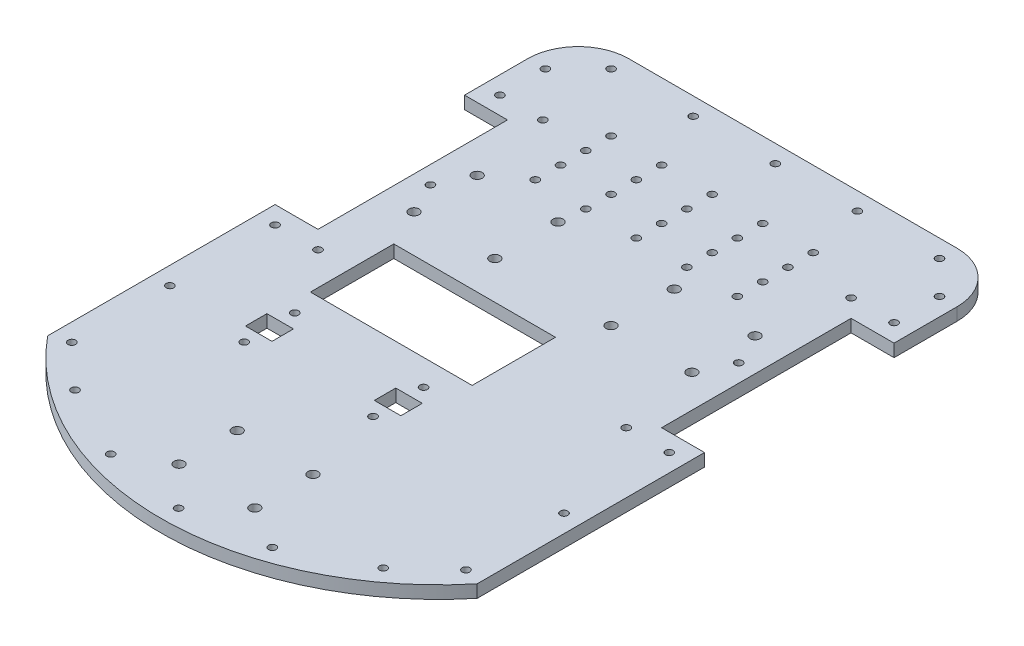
ISO-10303-21;
HEADER;
FILE_DESCRIPTION(('STEP AP214'),'2;1');
FILE_NAME('part.step','',(''),(''),'','','');
FILE_SCHEMA(('AUTOMOTIVE_DESIGN { 1 0 10303 214 1 1 1 1 }'));
ENDSEC;
DATA;
#1=APPLICATION_CONTEXT('core data for automotive mechanical design processes');
#2=APPLICATION_PROTOCOL_DEFINITION('international standard','automotive_design',2000,#1);
#3=PRODUCT_CONTEXT('',#1,'mechanical');
#4=PRODUCT('Part','Part','',(#3));
#5=PRODUCT_RELATED_PRODUCT_CATEGORY('part','',(#4));
#6=PRODUCT_DEFINITION_FORMATION('','',#4);
#7=PRODUCT_DEFINITION_CONTEXT('part definition',#1,'design');
#8=PRODUCT_DEFINITION('design','',#6,#7);
#9=PRODUCT_DEFINITION_SHAPE('','',#8);
#10=(LENGTH_UNIT() NAMED_UNIT(*) SI_UNIT(.MILLI.,.METRE.));
#11=(NAMED_UNIT(*) PLANE_ANGLE_UNIT() SI_UNIT($,.RADIAN.));
#12=(NAMED_UNIT(*) SI_UNIT($,.STERADIAN.) SOLID_ANGLE_UNIT());
#13=UNCERTAINTY_MEASURE_WITH_UNIT(LENGTH_MEASURE(1.E-05),#10,'distance_accuracy_value','');
#14=(GEOMETRIC_REPRESENTATION_CONTEXT(3) GLOBAL_UNCERTAINTY_ASSIGNED_CONTEXT((#13)) GLOBAL_UNIT_ASSIGNED_CONTEXT((#10,
#11,#12)) REPRESENTATION_CONTEXT('',''));
#15=CARTESIAN_POINT('',(0.,0.,0.));
#16=DIRECTION('',(0.,0.,1.));
#17=DIRECTION('',(1.,0.,0.));
#18=AXIS2_PLACEMENT_3D('',#15,#16,#17);
#19=CARTESIAN_POINT('',(-42.,5.,-85.));
#20=DIRECTION('',(0.,-1.,0.));
#21=DIRECTION('',(0.,0.,-1.));
#22=AXIS2_PLACEMENT_3D('',#19,#20,#21);
#23=CYLINDRICAL_SURFACE('',#22,1.5);
#24=CARTESIAN_POINT('',(-42.,5.,-85.));
#25=DIRECTION('',(0.,-1.,0.));
#26=DIRECTION('',(0.,0.,-1.));
#27=AXIS2_PLACEMENT_3D('',#24,#25,#26);
#28=CIRCLE('',#27,1.5);
#29=CARTESIAN_POINT('',(-42.,5.,-86.5));
#30=VERTEX_POINT('',#29);
#31=EDGE_CURVE('E41',#30,#30,#28,.T.);
#32=ORIENTED_EDGE('',*,*,#31,.F.);
#33=EDGE_LOOP('',(#32));
#34=FACE_BOUND('',#33,.T.);
#35=CARTESIAN_POINT('',(-42.,0.,-85.));
#36=DIRECTION('',(0.,-1.,0.));
#37=DIRECTION('',(0.,0.,-1.));
#38=AXIS2_PLACEMENT_3D('',#35,#36,#37);
#39=CIRCLE('',#38,1.5);
#40=CARTESIAN_POINT('',(-42.,0.,-86.5));
#41=VERTEX_POINT('',#40);
#42=EDGE_CURVE('E11',#41,#41,#39,.T.);
#43=ORIENTED_EDGE('',*,*,#42,.T.);
#44=EDGE_LOOP('',(#43));
#45=FACE_BOUND('',#44,.T.);
#46=ADVANCED_FACE('F34',(#34,#45),#23,.F.);
#47=CARTESIAN_POINT('',(-22.,5.,-85.));
#48=DIRECTION('',(0.,-1.,0.));
#49=DIRECTION('',(0.,0.,-1.));
#50=AXIS2_PLACEMENT_3D('',#47,#48,#49);
#51=CYLINDRICAL_SURFACE('',#50,1.5);
#52=CARTESIAN_POINT('',(-22.,5.,-85.));
#53=DIRECTION('',(0.,-1.,0.));
#54=DIRECTION('',(0.,0.,-1.));
#55=AXIS2_PLACEMENT_3D('',#52,#53,#54);
#56=CIRCLE('',#55,1.5);
#57=CARTESIAN_POINT('',(-22.,5.,-86.5));
#58=VERTEX_POINT('',#57);
#59=EDGE_CURVE('E593',#58,#58,#56,.T.);
#60=ORIENTED_EDGE('',*,*,#59,.F.);
#61=EDGE_LOOP('',(#60));
#62=FACE_BOUND('',#61,.T.);
#63=CARTESIAN_POINT('',(-22.,0.,-85.));
#64=DIRECTION('',(0.,-1.,0.));
#65=DIRECTION('',(0.,0.,-1.));
#66=AXIS2_PLACEMENT_3D('',#63,#64,#65);
#67=CIRCLE('',#66,1.5);
#68=CARTESIAN_POINT('',(-22.,0.,-86.5));
#69=VERTEX_POINT('',#68);
#70=EDGE_CURVE('E596',#69,#69,#67,.T.);
#71=ORIENTED_EDGE('',*,*,#70,.T.);
#72=EDGE_LOOP('',(#71));
#73=FACE_BOUND('',#72,.T.);
#74=ADVANCED_FACE('F605',(#62,#73),#51,.F.);
#75=CARTESIAN_POINT('',(-1.99999999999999,5.,-85.));
#76=DIRECTION('',(0.,-1.,0.));
#77=DIRECTION('',(0.,0.,-1.));
#78=AXIS2_PLACEMENT_3D('',#75,#76,#77);
#79=CYLINDRICAL_SURFACE('',#78,1.5);
#80=CARTESIAN_POINT('',(-1.99999999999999,5.,-85.));
#81=DIRECTION('',(0.,-1.,0.));
#82=DIRECTION('',(0.,0.,-1.));
#83=AXIS2_PLACEMENT_3D('',#80,#81,#82);
#84=CIRCLE('',#83,1.5);
#85=CARTESIAN_POINT('',(-1.99999999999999,5.,-86.5));
#86=VERTEX_POINT('',#85);
#87=EDGE_CURVE('E587',#86,#86,#84,.T.);
#88=ORIENTED_EDGE('',*,*,#87,.F.);
#89=EDGE_LOOP('',(#88));
#90=FACE_BOUND('',#89,.T.);
#91=CARTESIAN_POINT('',(-1.99999999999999,0.,-85.));
#92=DIRECTION('',(0.,-1.,0.));
#93=DIRECTION('',(0.,0.,-1.));
#94=AXIS2_PLACEMENT_3D('',#91,#92,#93);
#95=CIRCLE('',#94,1.5);
#96=CARTESIAN_POINT('',(-1.99999999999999,0.,-86.5));
#97=VERTEX_POINT('',#96);
#98=EDGE_CURVE('E590',#97,#97,#95,.T.);
#99=ORIENTED_EDGE('',*,*,#98,.T.);
#100=EDGE_LOOP('',(#99));
#101=FACE_BOUND('',#100,.T.);
#102=ADVANCED_FACE('F736',(#90,#101),#79,.F.);
#103=CARTESIAN_POINT('',(18.,5.,-85.));
#104=DIRECTION('',(0.,-1.,0.));
#105=DIRECTION('',(0.,0.,-1.));
#106=AXIS2_PLACEMENT_3D('',#103,#104,#105);
#107=CYLINDRICAL_SURFACE('',#106,1.5);
#108=CARTESIAN_POINT('',(18.,5.,-85.));
#109=DIRECTION('',(0.,-1.,0.));
#110=DIRECTION('',(0.,0.,-1.));
#111=AXIS2_PLACEMENT_3D('',#108,#109,#110);
#112=CIRCLE('',#111,1.5);
#113=CARTESIAN_POINT('',(18.,5.,-86.5));
#114=VERTEX_POINT('',#113);
#115=EDGE_CURVE('E581',#114,#114,#112,.T.);
#116=ORIENTED_EDGE('',*,*,#115,.F.);
#117=EDGE_LOOP('',(#116));
#118=FACE_BOUND('',#117,.T.);
#119=CARTESIAN_POINT('',(18.,0.,-85.));
#120=DIRECTION('',(0.,-1.,0.));
#121=DIRECTION('',(0.,0.,-1.));
#122=AXIS2_PLACEMENT_3D('',#119,#120,#121);
#123=CIRCLE('',#122,1.5);
#124=CARTESIAN_POINT('',(18.,0.,-86.5));
#125=VERTEX_POINT('',#124);
#126=EDGE_CURVE('E584',#125,#125,#123,.T.);
#127=ORIENTED_EDGE('',*,*,#126,.T.);
#128=EDGE_LOOP('',(#127));
#129=FACE_BOUND('',#128,.T.);
#130=ADVANCED_FACE('F732',(#118,#129),#107,.F.);
#131=CARTESIAN_POINT('',(38.,5.,-85.));
#132=DIRECTION('',(0.,-1.,0.));
#133=DIRECTION('',(0.,0.,-1.));
#134=AXIS2_PLACEMENT_3D('',#131,#132,#133);
#135=CYLINDRICAL_SURFACE('',#134,1.5);
#136=CARTESIAN_POINT('',(38.,5.,-85.));
#137=DIRECTION('',(0.,-1.,0.));
#138=DIRECTION('',(0.,0.,-1.));
#139=AXIS2_PLACEMENT_3D('',#136,#137,#138);
#140=CIRCLE('',#139,1.5);
#141=CARTESIAN_POINT('',(38.,5.,-86.5));
#142=VERTEX_POINT('',#141);
#143=EDGE_CURVE('E575',#142,#142,#140,.T.);
#144=ORIENTED_EDGE('',*,*,#143,.F.);
#145=EDGE_LOOP('',(#144));
#146=FACE_BOUND('',#145,.T.);
#147=CARTESIAN_POINT('',(38.,0.,-85.));
#148=DIRECTION('',(0.,-1.,0.));
#149=DIRECTION('',(0.,0.,-1.));
#150=AXIS2_PLACEMENT_3D('',#147,#148,#149);
#151=CIRCLE('',#150,1.5);
#152=CARTESIAN_POINT('',(38.,0.,-86.5));
#153=VERTEX_POINT('',#152);
#154=EDGE_CURVE('E578',#153,#153,#151,.T.);
#155=ORIENTED_EDGE('',*,*,#154,.T.);
#156=EDGE_LOOP('',(#155));
#157=FACE_BOUND('',#156,.T.);
#158=ADVANCED_FACE('F728',(#146,#157),#135,.F.);
#159=CARTESIAN_POINT('',(-42.,5.,-95.));
#160=DIRECTION('',(0.,-1.,0.));
#161=DIRECTION('',(0.,0.,-1.));
#162=AXIS2_PLACEMENT_3D('',#159,#160,#161);
#163=CYLINDRICAL_SURFACE('',#162,1.5);
#164=CARTESIAN_POINT('',(-42.,5.,-95.));
#165=DIRECTION('',(0.,-1.,0.));
#166=DIRECTION('',(0.,0.,-1.));
#167=AXIS2_PLACEMENT_3D('',#164,#165,#166);
#168=CIRCLE('',#167,1.5);
#169=CARTESIAN_POINT('',(-42.,5.,-96.5));
#170=VERTEX_POINT('',#169);
#171=EDGE_CURVE('E569',#170,#170,#168,.T.);
#172=ORIENTED_EDGE('',*,*,#171,.F.);
#173=EDGE_LOOP('',(#172));
#174=FACE_BOUND('',#173,.T.);
#175=CARTESIAN_POINT('',(-42.,0.,-95.));
#176=DIRECTION('',(0.,-1.,0.));
#177=DIRECTION('',(0.,0.,-1.));
#178=AXIS2_PLACEMENT_3D('',#175,#176,#177);
#179=CIRCLE('',#178,1.5);
#180=CARTESIAN_POINT('',(-42.,0.,-96.5));
#181=VERTEX_POINT('',#180);
#182=EDGE_CURVE('E572',#181,#181,#179,.T.);
#183=ORIENTED_EDGE('',*,*,#182,.T.);
#184=EDGE_LOOP('',(#183));
#185=FACE_BOUND('',#184,.T.);
#186=ADVANCED_FACE('F724',(#174,#185),#163,.F.);
#187=CARTESIAN_POINT('',(-22.,5.,-95.));
#188=DIRECTION('',(0.,-1.,0.));
#189=DIRECTION('',(0.,0.,-1.));
#190=AXIS2_PLACEMENT_3D('',#187,#188,#189);
#191=CYLINDRICAL_SURFACE('',#190,1.5);
#192=CARTESIAN_POINT('',(-22.,5.,-95.));
#193=DIRECTION('',(0.,-1.,0.));
#194=DIRECTION('',(0.,0.,-1.));
#195=AXIS2_PLACEMENT_3D('',#192,#193,#194);
#196=CIRCLE('',#195,1.5);
#197=CARTESIAN_POINT('',(-22.,5.,-96.5));
#198=VERTEX_POINT('',#197);
#199=EDGE_CURVE('E563',#198,#198,#196,.T.);
#200=ORIENTED_EDGE('',*,*,#199,.F.);
#201=EDGE_LOOP('',(#200));
#202=FACE_BOUND('',#201,.T.);
#203=CARTESIAN_POINT('',(-22.,0.,-95.));
#204=DIRECTION('',(0.,-1.,0.));
#205=DIRECTION('',(0.,0.,-1.));
#206=AXIS2_PLACEMENT_3D('',#203,#204,#205);
#207=CIRCLE('',#206,1.5);
#208=CARTESIAN_POINT('',(-22.,0.,-96.5));
#209=VERTEX_POINT('',#208);
#210=EDGE_CURVE('E566',#209,#209,#207,.T.);
#211=ORIENTED_EDGE('',*,*,#210,.T.);
#212=EDGE_LOOP('',(#211));
#213=FACE_BOUND('',#212,.T.);
#214=ADVANCED_FACE('F720',(#202,#213),#191,.F.);
#215=CARTESIAN_POINT('',(-1.99999999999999,5.,-95.));
#216=DIRECTION('',(0.,-1.,0.));
#217=DIRECTION('',(0.,0.,-1.));
#218=AXIS2_PLACEMENT_3D('',#215,#216,#217);
#219=CYLINDRICAL_SURFACE('',#218,1.5);
#220=CARTESIAN_POINT('',(-1.99999999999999,5.,-95.));
#221=DIRECTION('',(0.,-1.,0.));
#222=DIRECTION('',(0.,0.,-1.));
#223=AXIS2_PLACEMENT_3D('',#220,#221,#222);
#224=CIRCLE('',#223,1.5);
#225=CARTESIAN_POINT('',(-1.99999999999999,5.,-96.5));
#226=VERTEX_POINT('',#225);
#227=EDGE_CURVE('E557',#226,#226,#224,.T.);
#228=ORIENTED_EDGE('',*,*,#227,.F.);
#229=EDGE_LOOP('',(#228));
#230=FACE_BOUND('',#229,.T.);
#231=CARTESIAN_POINT('',(-1.99999999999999,0.,-95.));
#232=DIRECTION('',(0.,-1.,0.));
#233=DIRECTION('',(0.,0.,-1.));
#234=AXIS2_PLACEMENT_3D('',#231,#232,#233);
#235=CIRCLE('',#234,1.5);
#236=CARTESIAN_POINT('',(-1.99999999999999,0.,-96.5));
#237=VERTEX_POINT('',#236);
#238=EDGE_CURVE('E560',#237,#237,#235,.T.);
#239=ORIENTED_EDGE('',*,*,#238,.T.);
#240=EDGE_LOOP('',(#239));
#241=FACE_BOUND('',#240,.T.);
#242=ADVANCED_FACE('F716',(#230,#241),#219,.F.);
#243=CARTESIAN_POINT('',(18.,5.,-95.));
#244=DIRECTION('',(0.,-1.,0.));
#245=DIRECTION('',(0.,0.,-1.));
#246=AXIS2_PLACEMENT_3D('',#243,#244,#245);
#247=CYLINDRICAL_SURFACE('',#246,1.5);
#248=CARTESIAN_POINT('',(18.,5.,-95.));
#249=DIRECTION('',(0.,-1.,0.));
#250=DIRECTION('',(0.,0.,-1.));
#251=AXIS2_PLACEMENT_3D('',#248,#249,#250);
#252=CIRCLE('',#251,1.5);
#253=CARTESIAN_POINT('',(18.,5.,-96.5));
#254=VERTEX_POINT('',#253);
#255=EDGE_CURVE('E551',#254,#254,#252,.T.);
#256=ORIENTED_EDGE('',*,*,#255,.F.);
#257=EDGE_LOOP('',(#256));
#258=FACE_BOUND('',#257,.T.);
#259=CARTESIAN_POINT('',(18.,0.,-95.));
#260=DIRECTION('',(0.,-1.,0.));
#261=DIRECTION('',(0.,0.,-1.));
#262=AXIS2_PLACEMENT_3D('',#259,#260,#261);
#263=CIRCLE('',#262,1.5);
#264=CARTESIAN_POINT('',(18.,0.,-96.5));
#265=VERTEX_POINT('',#264);
#266=EDGE_CURVE('E554',#265,#265,#263,.T.);
#267=ORIENTED_EDGE('',*,*,#266,.T.);
#268=EDGE_LOOP('',(#267));
#269=FACE_BOUND('',#268,.T.);
#270=ADVANCED_FACE('F712',(#258,#269),#247,.F.);
#271=CARTESIAN_POINT('',(38.,5.,-95.0000000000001));
#272=DIRECTION('',(0.,-1.,0.));
#273=DIRECTION('',(0.,0.,-1.));
#274=AXIS2_PLACEMENT_3D('',#271,#272,#273);
#275=CYLINDRICAL_SURFACE('',#274,1.5);
#276=CARTESIAN_POINT('',(38.,5.,-95.0000000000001));
#277=DIRECTION('',(0.,-1.,0.));
#278=DIRECTION('',(0.,0.,-1.));
#279=AXIS2_PLACEMENT_3D('',#276,#277,#278);
#280=CIRCLE('',#279,1.5);
#281=CARTESIAN_POINT('',(38.,5.,-96.5000000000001));
#282=VERTEX_POINT('',#281);
#283=EDGE_CURVE('E545',#282,#282,#280,.T.);
#284=ORIENTED_EDGE('',*,*,#283,.F.);
#285=EDGE_LOOP('',(#284));
#286=FACE_BOUND('',#285,.T.);
#287=CARTESIAN_POINT('',(38.,0.,-95.0000000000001));
#288=DIRECTION('',(0.,-1.,0.));
#289=DIRECTION('',(0.,0.,-1.));
#290=AXIS2_PLACEMENT_3D('',#287,#288,#289);
#291=CIRCLE('',#290,1.5);
#292=CARTESIAN_POINT('',(38.,0.,-96.5000000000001));
#293=VERTEX_POINT('',#292);
#294=EDGE_CURVE('E548',#293,#293,#291,.T.);
#295=ORIENTED_EDGE('',*,*,#294,.T.);
#296=EDGE_LOOP('',(#295));
#297=FACE_BOUND('',#296,.T.);
#298=ADVANCED_FACE('F708',(#286,#297),#275,.F.);
#299=CARTESIAN_POINT('',(-42.,5.,-105.));
#300=DIRECTION('',(0.,-1.,0.));
#301=DIRECTION('',(0.,0.,-1.));
#302=AXIS2_PLACEMENT_3D('',#299,#300,#301);
#303=CYLINDRICAL_SURFACE('',#302,1.5);
#304=CARTESIAN_POINT('',(-42.,5.,-105.));
#305=DIRECTION('',(0.,-1.,0.));
#306=DIRECTION('',(0.,0.,-1.));
#307=AXIS2_PLACEMENT_3D('',#304,#305,#306);
#308=CIRCLE('',#307,1.5);
#309=CARTESIAN_POINT('',(-42.,5.,-106.5));
#310=VERTEX_POINT('',#309);
#311=EDGE_CURVE('E539',#310,#310,#308,.T.);
#312=ORIENTED_EDGE('',*,*,#311,.F.);
#313=EDGE_LOOP('',(#312));
#314=FACE_BOUND('',#313,.T.);
#315=CARTESIAN_POINT('',(-42.,0.,-105.));
#316=DIRECTION('',(0.,-1.,0.));
#317=DIRECTION('',(0.,0.,-1.));
#318=AXIS2_PLACEMENT_3D('',#315,#316,#317);
#319=CIRCLE('',#318,1.5);
#320=CARTESIAN_POINT('',(-42.,0.,-106.5));
#321=VERTEX_POINT('',#320);
#322=EDGE_CURVE('E542',#321,#321,#319,.T.);
#323=ORIENTED_EDGE('',*,*,#322,.T.);
#324=EDGE_LOOP('',(#323));
#325=FACE_BOUND('',#324,.T.);
#326=ADVANCED_FACE('F704',(#314,#325),#303,.F.);
#327=CARTESIAN_POINT('',(-22.,5.,-105.));
#328=DIRECTION('',(0.,-1.,0.));
#329=DIRECTION('',(0.,0.,-1.));
#330=AXIS2_PLACEMENT_3D('',#327,#328,#329);
#331=CYLINDRICAL_SURFACE('',#330,1.5);
#332=CARTESIAN_POINT('',(-22.,5.,-105.));
#333=DIRECTION('',(0.,-1.,0.));
#334=DIRECTION('',(0.,0.,-1.));
#335=AXIS2_PLACEMENT_3D('',#332,#333,#334);
#336=CIRCLE('',#335,1.5);
#337=CARTESIAN_POINT('',(-22.,5.,-106.5));
#338=VERTEX_POINT('',#337);
#339=EDGE_CURVE('E533',#338,#338,#336,.T.);
#340=ORIENTED_EDGE('',*,*,#339,.F.);
#341=EDGE_LOOP('',(#340));
#342=FACE_BOUND('',#341,.T.);
#343=CARTESIAN_POINT('',(-22.,0.,-105.));
#344=DIRECTION('',(0.,-1.,0.));
#345=DIRECTION('',(0.,0.,-1.));
#346=AXIS2_PLACEMENT_3D('',#343,#344,#345);
#347=CIRCLE('',#346,1.5);
#348=CARTESIAN_POINT('',(-22.,0.,-106.5));
#349=VERTEX_POINT('',#348);
#350=EDGE_CURVE('E536',#349,#349,#347,.T.);
#351=ORIENTED_EDGE('',*,*,#350,.T.);
#352=EDGE_LOOP('',(#351));
#353=FACE_BOUND('',#352,.T.);
#354=ADVANCED_FACE('F700',(#342,#353),#331,.F.);
#355=CARTESIAN_POINT('',(-1.99999999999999,5.,-105.));
#356=DIRECTION('',(0.,-1.,0.));
#357=DIRECTION('',(0.,0.,-1.));
#358=AXIS2_PLACEMENT_3D('',#355,#356,#357);
#359=CYLINDRICAL_SURFACE('',#358,1.5);
#360=CARTESIAN_POINT('',(-1.99999999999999,5.,-105.));
#361=DIRECTION('',(0.,-1.,0.));
#362=DIRECTION('',(0.,0.,-1.));
#363=AXIS2_PLACEMENT_3D('',#360,#361,#362);
#364=CIRCLE('',#363,1.5);
#365=CARTESIAN_POINT('',(-1.99999999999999,5.,-106.5));
#366=VERTEX_POINT('',#365);
#367=EDGE_CURVE('E527',#366,#366,#364,.T.);
#368=ORIENTED_EDGE('',*,*,#367,.F.);
#369=EDGE_LOOP('',(#368));
#370=FACE_BOUND('',#369,.T.);
#371=CARTESIAN_POINT('',(-1.99999999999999,0.,-105.));
#372=DIRECTION('',(0.,-1.,0.));
#373=DIRECTION('',(0.,0.,-1.));
#374=AXIS2_PLACEMENT_3D('',#371,#372,#373);
#375=CIRCLE('',#374,1.5);
#376=CARTESIAN_POINT('',(-1.99999999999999,0.,-106.5));
#377=VERTEX_POINT('',#376);
#378=EDGE_CURVE('E530',#377,#377,#375,.T.);
#379=ORIENTED_EDGE('',*,*,#378,.T.);
#380=EDGE_LOOP('',(#379));
#381=FACE_BOUND('',#380,.T.);
#382=ADVANCED_FACE('F696',(#370,#381),#359,.F.);
#383=CARTESIAN_POINT('',(18.,5.,-105.));
#384=DIRECTION('',(0.,-1.,0.));
#385=DIRECTION('',(0.,0.,-1.));
#386=AXIS2_PLACEMENT_3D('',#383,#384,#385);
#387=CYLINDRICAL_SURFACE('',#386,1.5);
#388=CARTESIAN_POINT('',(18.,5.,-105.));
#389=DIRECTION('',(0.,-1.,0.));
#390=DIRECTION('',(0.,0.,-1.));
#391=AXIS2_PLACEMENT_3D('',#388,#389,#390);
#392=CIRCLE('',#391,1.5);
#393=CARTESIAN_POINT('',(18.,5.,-106.5));
#394=VERTEX_POINT('',#393);
#395=EDGE_CURVE('E521',#394,#394,#392,.T.);
#396=ORIENTED_EDGE('',*,*,#395,.F.);
#397=EDGE_LOOP('',(#396));
#398=FACE_BOUND('',#397,.T.);
#399=CARTESIAN_POINT('',(18.,0.,-105.));
#400=DIRECTION('',(0.,-1.,0.));
#401=DIRECTION('',(0.,0.,-1.));
#402=AXIS2_PLACEMENT_3D('',#399,#400,#401);
#403=CIRCLE('',#402,1.5);
#404=CARTESIAN_POINT('',(18.,0.,-106.5));
#405=VERTEX_POINT('',#404);
#406=EDGE_CURVE('E524',#405,#405,#403,.T.);
#407=ORIENTED_EDGE('',*,*,#406,.T.);
#408=EDGE_LOOP('',(#407));
#409=FACE_BOUND('',#408,.T.);
#410=ADVANCED_FACE('F692',(#398,#409),#387,.F.);
#411=CARTESIAN_POINT('',(38.,5.,-105.));
#412=DIRECTION('',(0.,-1.,0.));
#413=DIRECTION('',(0.,0.,-1.));
#414=AXIS2_PLACEMENT_3D('',#411,#412,#413);
#415=CYLINDRICAL_SURFACE('',#414,1.5);
#416=CARTESIAN_POINT('',(38.,5.,-105.));
#417=DIRECTION('',(0.,-1.,0.));
#418=DIRECTION('',(0.,0.,-1.));
#419=AXIS2_PLACEMENT_3D('',#416,#417,#418);
#420=CIRCLE('',#419,1.5);
#421=CARTESIAN_POINT('',(38.,5.,-106.5));
#422=VERTEX_POINT('',#421);
#423=EDGE_CURVE('E515',#422,#422,#420,.T.);
#424=ORIENTED_EDGE('',*,*,#423,.F.);
#425=EDGE_LOOP('',(#424));
#426=FACE_BOUND('',#425,.T.);
#427=CARTESIAN_POINT('',(38.,0.,-105.));
#428=DIRECTION('',(0.,-1.,0.));
#429=DIRECTION('',(0.,0.,-1.));
#430=AXIS2_PLACEMENT_3D('',#427,#428,#429);
#431=CIRCLE('',#430,1.5);
#432=CARTESIAN_POINT('',(38.,0.,-106.5));
#433=VERTEX_POINT('',#432);
#434=EDGE_CURVE('E518',#433,#433,#431,.T.);
#435=ORIENTED_EDGE('',*,*,#434,.T.);
#436=EDGE_LOOP('',(#435));
#437=FACE_BOUND('',#436,.T.);
#438=ADVANCED_FACE('F688',(#426,#437),#415,.F.);
#439=CARTESIAN_POINT('',(-42.,5.,-115.));
#440=DIRECTION('',(0.,-1.,0.));
#441=DIRECTION('',(0.,0.,-1.));
#442=AXIS2_PLACEMENT_3D('',#439,#440,#441);
#443=CYLINDRICAL_SURFACE('',#442,1.5);
#444=CARTESIAN_POINT('',(-42.,5.,-115.));
#445=DIRECTION('',(0.,-1.,0.));
#446=DIRECTION('',(0.,0.,-1.));
#447=AXIS2_PLACEMENT_3D('',#444,#445,#446);
#448=CIRCLE('',#447,1.5);
#449=CARTESIAN_POINT('',(-42.,5.,-116.5));
#450=VERTEX_POINT('',#449);
#451=EDGE_CURVE('E509',#450,#450,#448,.T.);
#452=ORIENTED_EDGE('',*,*,#451,.F.);
#453=EDGE_LOOP('',(#452));
#454=FACE_BOUND('',#453,.T.);
#455=CARTESIAN_POINT('',(-42.,0.,-115.));
#456=DIRECTION('',(0.,-1.,0.));
#457=DIRECTION('',(0.,0.,-1.));
#458=AXIS2_PLACEMENT_3D('',#455,#456,#457);
#459=CIRCLE('',#458,1.5);
#460=CARTESIAN_POINT('',(-42.,0.,-116.5));
#461=VERTEX_POINT('',#460);
#462=EDGE_CURVE('E512',#461,#461,#459,.T.);
#463=ORIENTED_EDGE('',*,*,#462,.T.);
#464=EDGE_LOOP('',(#463));
#465=FACE_BOUND('',#464,.T.);
#466=ADVANCED_FACE('F684',(#454,#465),#443,.F.);
#467=CARTESIAN_POINT('',(-22.,5.,-115.));
#468=DIRECTION('',(0.,-1.,0.));
#469=DIRECTION('',(0.,0.,-1.));
#470=AXIS2_PLACEMENT_3D('',#467,#468,#469);
#471=CYLINDRICAL_SURFACE('',#470,1.5);
#472=CARTESIAN_POINT('',(-22.,5.,-115.));
#473=DIRECTION('',(0.,-1.,0.));
#474=DIRECTION('',(0.,0.,-1.));
#475=AXIS2_PLACEMENT_3D('',#472,#473,#474);
#476=CIRCLE('',#475,1.5);
#477=CARTESIAN_POINT('',(-22.,5.,-116.5));
#478=VERTEX_POINT('',#477);
#479=EDGE_CURVE('E503',#478,#478,#476,.T.);
#480=ORIENTED_EDGE('',*,*,#479,.F.);
#481=EDGE_LOOP('',(#480));
#482=FACE_BOUND('',#481,.T.);
#483=CARTESIAN_POINT('',(-22.,0.,-115.));
#484=DIRECTION('',(0.,-1.,0.));
#485=DIRECTION('',(0.,0.,-1.));
#486=AXIS2_PLACEMENT_3D('',#483,#484,#485);
#487=CIRCLE('',#486,1.5);
#488=CARTESIAN_POINT('',(-22.,0.,-116.5));
#489=VERTEX_POINT('',#488);
#490=EDGE_CURVE('E506',#489,#489,#487,.T.);
#491=ORIENTED_EDGE('',*,*,#490,.T.);
#492=EDGE_LOOP('',(#491));
#493=FACE_BOUND('',#492,.T.);
#494=ADVANCED_FACE('F680',(#482,#493),#471,.F.);
#495=CARTESIAN_POINT('',(-1.99999999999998,5.,-115.));
#496=DIRECTION('',(0.,-1.,0.));
#497=DIRECTION('',(0.,0.,-1.));
#498=AXIS2_PLACEMENT_3D('',#495,#496,#497);
#499=CYLINDRICAL_SURFACE('',#498,1.5);
#500=CARTESIAN_POINT('',(-1.99999999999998,5.,-115.));
#501=DIRECTION('',(0.,-1.,0.));
#502=DIRECTION('',(0.,0.,-1.));
#503=AXIS2_PLACEMENT_3D('',#500,#501,#502);
#504=CIRCLE('',#503,1.5);
#505=CARTESIAN_POINT('',(-1.99999999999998,5.,-116.5));
#506=VERTEX_POINT('',#505);
#507=EDGE_CURVE('E497',#506,#506,#504,.T.);
#508=ORIENTED_EDGE('',*,*,#507,.F.);
#509=EDGE_LOOP('',(#508));
#510=FACE_BOUND('',#509,.T.);
#511=CARTESIAN_POINT('',(-1.99999999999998,0.,-115.));
#512=DIRECTION('',(0.,-1.,0.));
#513=DIRECTION('',(0.,0.,-1.));
#514=AXIS2_PLACEMENT_3D('',#511,#512,#513);
#515=CIRCLE('',#514,1.5);
#516=CARTESIAN_POINT('',(-1.99999999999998,0.,-116.5));
#517=VERTEX_POINT('',#516);
#518=EDGE_CURVE('E500',#517,#517,#515,.T.);
#519=ORIENTED_EDGE('',*,*,#518,.T.);
#520=EDGE_LOOP('',(#519));
#521=FACE_BOUND('',#520,.T.);
#522=ADVANCED_FACE('F619',(#510,#521),#499,.F.);
#523=CARTESIAN_POINT('',(65.,5.,-125.));
#524=DIRECTION('',(0.,-1.,0.));
#525=DIRECTION('',(0.,0.,-1.));
#526=AXIS2_PLACEMENT_3D('',#523,#524,#525);
#527=PLANE('',#526);
#528=CARTESIAN_POINT('',(18.,5.,-115.));
#529=DIRECTION('',(0.,-1.,0.));
#530=DIRECTION('',(0.,0.,-1.));
#531=AXIS2_PLACEMENT_3D('',#528,#529,#530);
#532=CIRCLE('',#531,1.5);
#533=CARTESIAN_POINT('',(18.,5.,-116.5));
#534=VERTEX_POINT('',#533);
#535=EDGE_CURVE('E1919',#534,#534,#532,.T.);
#536=ORIENTED_EDGE('',*,*,#535,.T.);
#537=EDGE_LOOP('',(#536));
#538=FACE_BOUND('',#537,.T.);
#539=CARTESIAN_POINT('',(38.,5.,-115.));
#540=DIRECTION('',(0.,-1.,0.));
#541=DIRECTION('',(0.,0.,-1.));
#542=AXIS2_PLACEMENT_3D('',#539,#540,#541);
#543=CIRCLE('',#542,1.5);
#544=CARTESIAN_POINT('',(38.,5.,-116.5));
#545=VERTEX_POINT('',#544);
#546=EDGE_CURVE('E1891',#545,#545,#543,.T.);
#547=ORIENTED_EDGE('',*,*,#546,.T.);
#548=EDGE_LOOP('',(#547));
#549=FACE_BOUND('',#548,.T.);
#550=CARTESIAN_POINT('',(61.,5.,78.172775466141));
#551=DIRECTION('',(0.,1.,0.));
#552=DIRECTION('',(0.,0.,1.));
#553=AXIS2_PLACEMENT_3D('',#550,#551,#552);
#554=CIRCLE('',#553,1.5);
#555=CARTESIAN_POINT('',(61.,5.,79.672775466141));
#556=VERTEX_POINT('',#555);
#557=EDGE_CURVE('E1840',#556,#556,#554,.T.);
#558=ORIENTED_EDGE('',*,*,#557,.F.);
#559=EDGE_LOOP('',(#558));
#560=FACE_BOUND('',#559,.T.);
#561=CARTESIAN_POINT('',(78.0000000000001,5.,62.4469200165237));
#562=DIRECTION('',(0.,1.,0.));
#563=DIRECTION('',(0.,0.,1.));
#564=AXIS2_PLACEMENT_3D('',#561,#562,#563);
#565=CIRCLE('',#564,1.5);
#566=CARTESIAN_POINT('',(78.0000000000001,5.,63.9469200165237));
#567=VERTEX_POINT('',#566);
#568=EDGE_CURVE('E1870',#567,#567,#565,.T.);
#569=ORIENTED_EDGE('',*,*,#568,.F.);
#570=EDGE_LOOP('',(#569));
#571=FACE_BOUND('',#570,.T.);
#572=CARTESIAN_POINT('',(78.0000000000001,5.,23.6224286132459));
#573=DIRECTION('',(0.,1.,0.));
#574=DIRECTION('',(0.,0.,1.));
#575=AXIS2_PLACEMENT_3D('',#572,#573,#574);
#576=CIRCLE('',#575,1.5);
#577=CARTESIAN_POINT('',(78.0000000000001,5.,25.1224286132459));
#578=VERTEX_POINT('',#577);
#579=EDGE_CURVE('E1876',#578,#578,#576,.T.);
#580=ORIENTED_EDGE('',*,*,#579,.F.);
#581=EDGE_LOOP('',(#580));
#582=FACE_BOUND('',#581,.T.);
#583=CARTESIAN_POINT('',(78.,5.,-18.0000000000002));
#584=DIRECTION('',(0.,1.,0.));
#585=DIRECTION('',(0.,0.,1.));
#586=AXIS2_PLACEMENT_3D('',#583,#584,#585);
#587=CIRCLE('',#586,1.5);
#588=CARTESIAN_POINT('',(78.,5.,-16.5000000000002));
#589=VERTEX_POINT('',#588);
#590=EDGE_CURVE('E1882',#589,#589,#587,.T.);
#591=ORIENTED_EDGE('',*,*,#590,.F.);
#592=EDGE_LOOP('',(#591));
#593=FACE_BOUND('',#592,.T.);
#594=CARTESIAN_POINT('',(61.,5.,-18.0000000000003));
#595=DIRECTION('',(0.,1.,0.));
#596=DIRECTION('',(0.,0.,1.));
#597=AXIS2_PLACEMENT_3D('',#594,#595,#596);
#598=CIRCLE('',#597,1.5);
#599=CARTESIAN_POINT('',(61.,5.,-16.5000000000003));
#600=VERTEX_POINT('',#599);
#601=EDGE_CURVE('E1841',#600,#600,#598,.T.);
#602=ORIENTED_EDGE('',*,*,#601,.F.);
#603=EDGE_LOOP('',(#602));
#604=FACE_BOUND('',#603,.T.);
#605=CARTESIAN_POINT('',(61.,5.,-62.5));
#606=DIRECTION('',(0.,1.,0.));
#607=DIRECTION('',(0.,0.,1.));
#608=AXIS2_PLACEMENT_3D('',#605,#606,#607);
#609=CIRCLE('',#608,1.5);
#610=CARTESIAN_POINT('',(61.,5.,-61.));
#611=VERTEX_POINT('',#610);
#612=EDGE_CURVE('E1848',#611,#611,#609,.T.);
#613=ORIENTED_EDGE('',*,*,#612,.F.);
#614=EDGE_LOOP('',(#613));
#615=FACE_BOUND('',#614,.T.);
#616=CARTESIAN_POINT('',(61.,5.,-107.));
#617=DIRECTION('',(0.,1.,0.));
#618=DIRECTION('',(0.,0.,1.));
#619=AXIS2_PLACEMENT_3D('',#616,#617,#618);
#620=CIRCLE('',#619,1.5);
#621=CARTESIAN_POINT('',(61.,5.,-105.5));
#622=VERTEX_POINT('',#621);
#623=EDGE_CURVE('E1854',#622,#622,#620,.T.);
#624=ORIENTED_EDGE('',*,*,#623,.F.);
#625=EDGE_LOOP('',(#624));
#626=FACE_BOUND('',#625,.T.);
#627=CARTESIAN_POINT('',(78.,5.,-107.));
#628=DIRECTION('',(0.,1.,0.));
#629=DIRECTION('',(0.,0.,1.));
#630=AXIS2_PLACEMENT_3D('',#627,#628,#629);
#631=CIRCLE('',#630,1.5);
#632=CARTESIAN_POINT('',(78.,5.,-105.5));
#633=VERTEX_POINT('',#632);
#634=EDGE_CURVE('E1860',#633,#633,#631,.T.);
#635=ORIENTED_EDGE('',*,*,#634,.F.);
#636=EDGE_LOOP('',(#635));
#637=FACE_BOUND('',#636,.T.);
#638=CARTESIAN_POINT('',(32.,5.,93.0818130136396));
#639=DIRECTION('',(0.,1.,0.));
#640=DIRECTION('',(0.,0.,1.));
#641=AXIS2_PLACEMENT_3D('',#638,#639,#640);
#642=CIRCLE('',#641,1.5);
#643=CARTESIAN_POINT('',(32.,5.,94.5818130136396));
#644=VERTEX_POINT('',#643);
#645=EDGE_CURVE('E1834',#644,#644,#642,.T.);
#646=ORIENTED_EDGE('',*,*,#645,.F.);
#647=EDGE_LOOP('',(#646));
#648=FACE_BOUND('',#647,.T.);
#649=CARTESIAN_POINT('',(0.,5.,98.1787997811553));
#650=DIRECTION('',(0.,1.,0.));
#651=DIRECTION('',(0.,0.,1.));
#652=AXIS2_PLACEMENT_3D('',#649,#650,#651);
#653=CIRCLE('',#652,1.5);
#654=CARTESIAN_POINT('',(0.,5.,99.6787997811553));
#655=VERTEX_POINT('',#654);
#656=EDGE_CURVE('E1828',#655,#655,#653,.T.);
#657=ORIENTED_EDGE('',*,*,#656,.F.);
#658=EDGE_LOOP('',(#657));
#659=FACE_BOUND('',#658,.T.);
#660=CARTESIAN_POINT('',(-32.,5.,93.0818130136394));
#661=DIRECTION('',(0.,1.,0.));
#662=DIRECTION('',(0.,0.,-1.));
#663=AXIS2_PLACEMENT_3D('',#660,#661,#662);
#664=CIRCLE('',#663,1.5);
#665=CARTESIAN_POINT('',(-32.,5.,91.5818130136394));
#666=VERTEX_POINT('',#665);
#667=EDGE_CURVE('E1822',#666,#666,#664,.T.);
#668=ORIENTED_EDGE('',*,*,#667,.F.);
#669=EDGE_LOOP('',(#668));
#670=FACE_BOUND('',#669,.T.);
#671=CARTESIAN_POINT('',(-61.,5.,78.1727754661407));
#672=DIRECTION('',(0.,1.,0.));
#673=DIRECTION('',(0.,0.,-1.));
#674=AXIS2_PLACEMENT_3D('',#671,#672,#673);
#675=CIRCLE('',#674,1.5);
#676=CARTESIAN_POINT('',(-61.,5.,76.6727754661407));
#677=VERTEX_POINT('',#676);
#678=EDGE_CURVE('E1816',#677,#677,#675,.T.);
#679=ORIENTED_EDGE('',*,*,#678,.F.);
#680=EDGE_LOOP('',(#679));
#681=FACE_BOUND('',#680,.T.);
#682=CARTESIAN_POINT('',(-78.0000000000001,5.,62.4469200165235));
#683=DIRECTION('',(0.,1.,0.));
#684=DIRECTION('',(0.,0.,-1.));
#685=AXIS2_PLACEMENT_3D('',#682,#683,#684);
#686=CIRCLE('',#685,1.5);
#687=CARTESIAN_POINT('',(-78.0000000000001,5.,60.9469200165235));
#688=VERTEX_POINT('',#687);
#689=EDGE_CURVE('E1810',#688,#688,#686,.T.);
#690=ORIENTED_EDGE('',*,*,#689,.F.);
#691=EDGE_LOOP('',(#690));
#692=FACE_BOUND('',#691,.T.);
#693=CARTESIAN_POINT('',(-61.,5.,-18.0000000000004));
#694=DIRECTION('',(0.,1.,0.));
#695=DIRECTION('',(0.,0.,-1.));
#696=AXIS2_PLACEMENT_3D('',#693,#694,#695);
#697=CIRCLE('',#696,1.5);
#698=CARTESIAN_POINT('',(-61.,5.,-19.5000000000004));
#699=VERTEX_POINT('',#698);
#700=EDGE_CURVE('E1804',#699,#699,#697,.T.);
#701=ORIENTED_EDGE('',*,*,#700,.F.);
#702=EDGE_LOOP('',(#701));
#703=FACE_BOUND('',#702,.T.);
#704=CARTESIAN_POINT('',(-61.,5.,-62.5000000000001));
#705=DIRECTION('',(0.,1.,0.));
#706=DIRECTION('',(0.,0.,-1.));
#707=AXIS2_PLACEMENT_3D('',#704,#705,#706);
#708=CIRCLE('',#707,1.5);
#709=CARTESIAN_POINT('',(-61.,5.,-64.0000000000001));
#710=VERTEX_POINT('',#709);
#711=EDGE_CURVE('E1798',#710,#710,#708,.T.);
#712=ORIENTED_EDGE('',*,*,#711,.F.);
#713=EDGE_LOOP('',(#712));
#714=FACE_BOUND('',#713,.T.);
#715=CARTESIAN_POINT('',(-61.,5.,-107.));
#716=DIRECTION('',(0.,1.,0.));
#717=DIRECTION('',(0.,0.,-1.));
#718=AXIS2_PLACEMENT_3D('',#715,#716,#717);
#719=CIRCLE('',#718,1.5);
#720=CARTESIAN_POINT('',(-61.,5.,-108.5));
#721=VERTEX_POINT('',#720);
#722=EDGE_CURVE('E1791',#721,#721,#719,.T.);
#723=ORIENTED_EDGE('',*,*,#722,.F.);
#724=EDGE_LOOP('',(#723));
#725=FACE_BOUND('',#724,.T.);
#726=CARTESIAN_POINT('',(-78.0000000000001,5.,23.6224286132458));
#727=DIRECTION('',(0.,1.,0.));
#728=DIRECTION('',(0.,0.,-1.));
#729=AXIS2_PLACEMENT_3D('',#726,#727,#728);
#730=CIRCLE('',#729,1.5);
#731=CARTESIAN_POINT('',(-78.0000000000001,5.,22.1224286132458));
#732=VERTEX_POINT('',#731);
#733=EDGE_CURVE('E1906',#732,#732,#730,.T.);
#734=ORIENTED_EDGE('',*,*,#733,.F.);
#735=EDGE_LOOP('',(#734));
#736=FACE_BOUND('',#735,.T.);
#737=CARTESIAN_POINT('',(-78.,5.,-18.0000000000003));
#738=DIRECTION('',(0.,1.,0.));
#739=DIRECTION('',(0.,0.,-1.));
#740=AXIS2_PLACEMENT_3D('',#737,#738,#739);
#741=CIRCLE('',#740,1.5);
#742=CARTESIAN_POINT('',(-78.,5.,-19.5000000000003));
#743=VERTEX_POINT('',#742);
#744=EDGE_CURVE('E1900',#743,#743,#741,.T.);
#745=ORIENTED_EDGE('',*,*,#744,.F.);
#746=EDGE_LOOP('',(#745));
#747=FACE_BOUND('',#746,.T.);
#748=CARTESIAN_POINT('',(-78.,5.,-107.));
#749=DIRECTION('',(0.,1.,0.));
#750=DIRECTION('',(0.,0.,-1.));
#751=AXIS2_PLACEMENT_3D('',#748,#749,#750);
#752=CIRCLE('',#751,1.5);
#753=CARTESIAN_POINT('',(-78.,5.,-108.5));
#754=VERTEX_POINT('',#753);
#755=EDGE_CURVE('E1894',#754,#754,#752,.T.);
#756=ORIENTED_EDGE('',*,*,#755,.F.);
#757=EDGE_LOOP('',(#756));
#758=FACE_BOUND('',#757,.T.);
#759=CARTESIAN_POINT('',(-78.,5.,-125.));
#760=DIRECTION('',(0.,1.,0.));
#761=DIRECTION('',(0.,0.,-1.));
#762=AXIS2_PLACEMENT_3D('',#759,#760,#761);
#763=CIRCLE('',#762,1.5);
#764=CARTESIAN_POINT('',(-78.,5.,-126.5));
#765=VERTEX_POINT('',#764);
#766=EDGE_CURVE('E1887',#765,#765,#763,.T.);
#767=ORIENTED_EDGE('',*,*,#766,.F.);
#768=EDGE_LOOP('',(#767));
#769=FACE_BOUND('',#768,.T.);
#770=CARTESIAN_POINT('',(78.,5.,-125.));
#771=DIRECTION('',(0.,1.,0.));
#772=DIRECTION('',(0.,0.,1.));
#773=AXIS2_PLACEMENT_3D('',#770,#771,#772);
#774=CIRCLE('',#773,1.5);
#775=CARTESIAN_POINT('',(78.,5.,-123.5));
#776=VERTEX_POINT('',#775);
#777=EDGE_CURVE('E1785',#776,#776,#774,.T.);
#778=ORIENTED_EDGE('',*,*,#777,.F.);
#779=EDGE_LOOP('',(#778));
#780=FACE_BOUND('',#779,.T.);
#781=CARTESIAN_POINT('',(-32.5,5.,-138.));
#782=DIRECTION('',(0.,1.,0.));
#783=DIRECTION('',(0.,0.,1.));
#784=AXIS2_PLACEMENT_3D('',#781,#782,#783);
#785=CIRCLE('',#784,1.5);
#786=CARTESIAN_POINT('',(-32.5,5.,-136.5));
#787=VERTEX_POINT('',#786);
#788=EDGE_CURVE('E1780',#787,#787,#785,.T.);
#789=ORIENTED_EDGE('',*,*,#788,.F.);
#790=EDGE_LOOP('',(#789));
#791=FACE_BOUND('',#790,.T.);
#792=CARTESIAN_POINT('',(0.,5.,-138.));
#793=DIRECTION('',(0.,1.,0.));
#794=DIRECTION('',(0.,0.,1.));
#795=AXIS2_PLACEMENT_3D('',#792,#793,#794);
#796=CIRCLE('',#795,1.5);
#797=CARTESIAN_POINT('',(0.,5.,-136.5));
#798=VERTEX_POINT('',#797);
#799=EDGE_CURVE('E1774',#798,#798,#796,.T.);
#800=ORIENTED_EDGE('',*,*,#799,.F.);
#801=EDGE_LOOP('',(#800));
#802=FACE_BOUND('',#801,.T.);
#803=CARTESIAN_POINT('',(32.5,5.,-138.));
#804=DIRECTION('',(0.,1.,0.));
#805=DIRECTION('',(0.,0.,1.));
#806=AXIS2_PLACEMENT_3D('',#803,#804,#805);
#807=CIRCLE('',#806,1.5);
#808=CARTESIAN_POINT('',(32.5,5.,-136.5));
#809=VERTEX_POINT('',#808);
#810=EDGE_CURVE('E1768',#809,#809,#807,.T.);
#811=ORIENTED_EDGE('',*,*,#810,.F.);
#812=EDGE_LOOP('',(#811));
#813=FACE_BOUND('',#812,.T.);
#814=CARTESIAN_POINT('',(65.,5.,-138.));
#815=DIRECTION('',(0.,1.,0.));
#816=DIRECTION('',(0.,0.,1.));
#817=AXIS2_PLACEMENT_3D('',#814,#815,#816);
#818=CIRCLE('',#817,1.5);
#819=CARTESIAN_POINT('',(65.,5.,-136.5));
#820=VERTEX_POINT('',#819);
#821=EDGE_CURVE('E1761',#820,#820,#818,.T.);
#822=ORIENTED_EDGE('',*,*,#821,.F.);
#823=EDGE_LOOP('',(#822));
#824=FACE_BOUND('',#823,.T.);
#825=CARTESIAN_POINT('',(-65.,5.,-138.));
#826=DIRECTION('',(0.,1.,0.));
#827=DIRECTION('',(0.,0.,1.));
#828=AXIS2_PLACEMENT_3D('',#825,#826,#827);
#829=CIRCLE('',#828,1.5);
#830=CARTESIAN_POINT('',(-65.,5.,-136.5));
#831=VERTEX_POINT('',#830);
#832=EDGE_CURVE('E1742',#831,#831,#829,.T.);
#833=ORIENTED_EDGE('',*,*,#832,.F.);
#834=EDGE_LOOP('',(#833));
#835=FACE_BOUND('',#834,.T.);
#836=DIRECTION('',(1.,0.,0.));
#837=VECTOR('',#836,1.);
#838=CARTESIAN_POINT('',(-49.21,5.,22.5));
#839=LINE('',#838,#837);
#840=CARTESIAN_POINT('',(-49.21,5.,22.5));
#841=VERTEX_POINT('',#840);
#842=CARTESIAN_POINT('',(-38.71,5.,22.5));
#843=VERTEX_POINT('',#842);
#844=EDGE_CURVE('E230',#841,#843,#839,.T.);
#845=ORIENTED_EDGE('',*,*,#844,.F.);
#846=DIRECTION('',(0.,0.,1.));
#847=VECTOR('',#846,1.);
#848=CARTESIAN_POINT('',(-49.21,5.,14.));
#849=LINE('',#848,#847);
#850=CARTESIAN_POINT('',(-49.21,5.,14.));
#851=VERTEX_POINT('',#850);
#852=EDGE_CURVE('E48',#851,#841,#849,.T.);
#853=ORIENTED_EDGE('',*,*,#852,.F.);
#854=DIRECTION('',(-1.,0.,0.));
#855=VECTOR('',#854,1.);
#856=CARTESIAN_POINT('',(-49.21,5.,14.));
#857=LINE('',#856,#855);
#858=CARTESIAN_POINT('',(-38.71,5.,14.));
#859=VERTEX_POINT('',#858);
#860=EDGE_CURVE('E223',#859,#851,#857,.T.);
#861=ORIENTED_EDGE('',*,*,#860,.F.);
#862=DIRECTION('',(0.,0.,-1.));
#863=VECTOR('',#862,1.);
#864=CARTESIAN_POINT('',(-38.71,5.,14.));
#865=LINE('',#864,#863);
#866=EDGE_CURVE('E237',#843,#859,#865,.T.);
#867=ORIENTED_EDGE('',*,*,#866,.F.);
#868=EDGE_LOOP('',(#845,#853,#861,#867));
#869=FACE_BOUND('',#868,.T.);
#870=CARTESIAN_POINT('',(-43.96,5.,28.25));
#871=DIRECTION('',(0.,1.,0.));
#872=DIRECTION('',(0.,0.,1.));
#873=AXIS2_PLACEMENT_3D('',#870,#871,#872);
#874=CIRCLE('',#873,1.5);
#875=CARTESIAN_POINT('',(-43.96,5.,29.75));
#876=VERTEX_POINT('',#875);
#877=EDGE_CURVE('E246',#876,#876,#874,.T.);
#878=ORIENTED_EDGE('',*,*,#877,.F.);
#879=EDGE_LOOP('',(#878));
#880=FACE_BOUND('',#879,.T.);
#881=CARTESIAN_POINT('',(-43.96,5.,8.24999999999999));
#882=DIRECTION('',(0.,1.,0.));
#883=DIRECTION('',(0.,0.,1.));
#884=AXIS2_PLACEMENT_3D('',#881,#882,#883);
#885=CIRCLE('',#884,1.5);
#886=CARTESIAN_POINT('',(-43.96,5.,9.74999999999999));
#887=VERTEX_POINT('',#886);
#888=EDGE_CURVE('E252',#887,#887,#885,.T.);
#889=ORIENTED_EDGE('',*,*,#888,.F.);
#890=EDGE_LOOP('',(#889));
#891=FACE_BOUND('',#890,.T.);
#892=CARTESIAN_POINT('',(7.04000000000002,5.,8.24999999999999));
#893=DIRECTION('',(0.,1.,0.));
#894=DIRECTION('',(0.,0.,1.));
#895=AXIS2_PLACEMENT_3D('',#892,#893,#894);
#896=CIRCLE('',#895,1.5);
#897=CARTESIAN_POINT('',(7.04000000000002,5.,9.74999999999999));
#898=VERTEX_POINT('',#897);
#899=EDGE_CURVE('E258',#898,#898,#896,.T.);
#900=ORIENTED_EDGE('',*,*,#899,.F.);
#901=EDGE_LOOP('',(#900));
#902=FACE_BOUND('',#901,.T.);
#903=CARTESIAN_POINT('',(7.04000000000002,5.,28.25));
#904=DIRECTION('',(0.,1.,0.));
#905=DIRECTION('',(0.,0.,1.));
#906=AXIS2_PLACEMENT_3D('',#903,#904,#905);
#907=CIRCLE('',#906,1.5);
#908=CARTESIAN_POINT('',(7.04000000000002,5.,29.75));
#909=VERTEX_POINT('',#908);
#910=EDGE_CURVE('E264',#909,#909,#907,.T.);
#911=ORIENTED_EDGE('',*,*,#910,.F.);
#912=EDGE_LOOP('',(#911));
#913=FACE_BOUND('',#912,.T.);
#914=DIRECTION('',(-1.,0.,0.));
#915=VECTOR('',#914,1.);
#916=CARTESIAN_POINT('',(12.29,5.,14.));
#917=LINE('',#916,#915);
#918=CARTESIAN_POINT('',(12.29,5.,14.));
#919=VERTEX_POINT('',#918);
#920=CARTESIAN_POINT('',(1.79000000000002,5.,14.));
#921=VERTEX_POINT('',#920);
#922=EDGE_CURVE('E274',#919,#921,#917,.T.);
#923=ORIENTED_EDGE('',*,*,#922,.F.);
#924=DIRECTION('',(0.,0.,-1.));
#925=VECTOR('',#924,1.);
#926=CARTESIAN_POINT('',(12.29,5.,14.));
#927=LINE('',#926,#925);
#928=CARTESIAN_POINT('',(12.29,5.,22.5));
#929=VERTEX_POINT('',#928);
#930=EDGE_CURVE('E56',#929,#919,#927,.T.);
#931=ORIENTED_EDGE('',*,*,#930,.F.);
#932=DIRECTION('',(1.,0.,0.));
#933=VECTOR('',#932,1.);
#934=CARTESIAN_POINT('',(12.29,5.,22.5));
#935=LINE('',#934,#933);
#936=CARTESIAN_POINT('',(1.79000000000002,5.,22.5));
#937=VERTEX_POINT('',#936);
#938=EDGE_CURVE('E280',#937,#929,#935,.T.);
#939=ORIENTED_EDGE('',*,*,#938,.F.);
#940=DIRECTION('',(0.,0.,1.));
#941=VECTOR('',#940,1.);
#942=CARTESIAN_POINT('',(1.79000000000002,5.,14.));
#943=LINE('',#942,#941);
#944=EDGE_CURVE('E277',#921,#937,#943,.T.);
#945=ORIENTED_EDGE('',*,*,#944,.F.);
#946=EDGE_LOOP('',(#923,#931,#939,#945));
#947=FACE_BOUND('',#946,.T.);
#948=CARTESIAN_POINT('',(-15.,5.,83.));
#949=DIRECTION('',(0.,1.,0.));
#950=DIRECTION('',(0.,0.,1.));
#951=AXIS2_PLACEMENT_3D('',#948,#949,#950);
#952=CIRCLE('',#951,2.);
#953=CARTESIAN_POINT('',(-15.,5.,85.));
#954=VERTEX_POINT('',#953);
#955=EDGE_CURVE('E386',#954,#954,#952,.T.);
#956=ORIENTED_EDGE('',*,*,#955,.F.);
#957=EDGE_LOOP('',(#956));
#958=FACE_BOUND('',#957,.T.);
#959=CARTESIAN_POINT('',(15.,5.,83.));
#960=DIRECTION('',(0.,1.,0.));
#961=DIRECTION('',(0.,0.,1.));
#962=AXIS2_PLACEMENT_3D('',#959,#960,#961);
#963=CIRCLE('',#962,2.00000000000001);
#964=CARTESIAN_POINT('',(15.,5.,85.));
#965=VERTEX_POINT('',#964);
#966=EDGE_CURVE('E392',#965,#965,#963,.T.);
#967=ORIENTED_EDGE('',*,*,#966,.F.);
#968=EDGE_LOOP('',(#967));
#969=FACE_BOUND('',#968,.T.);
#970=CARTESIAN_POINT('',(65.,5.,-125.));
#971=DIRECTION('',(0.,1.,0.));
#972=DIRECTION('',(0.,0.,-1.));
#973=AXIS2_PLACEMENT_3D('',#970,#971,#972);
#974=CIRCLE('',#973,20.);
#975=CARTESIAN_POINT('',(85.,5.,-125.));
#976=VERTEX_POINT('',#975);
#977=CARTESIAN_POINT('',(65.,5.,-145.));
#978=VERTEX_POINT('',#977);
#979=EDGE_CURVE('E398',#976,#978,#974,.T.);
#980=ORIENTED_EDGE('',*,*,#979,.T.);
#981=DIRECTION('',(-1.,0.,0.));
#982=VECTOR('',#981,1.);
#983=CARTESIAN_POINT('',(-65.,5.,-145.));
#984=LINE('',#983,#982);
#985=CARTESIAN_POINT('',(-65.,5.,-145.));
#986=VERTEX_POINT('',#985);
#987=EDGE_CURVE('E401',#978,#986,#984,.T.);
#988=ORIENTED_EDGE('',*,*,#987,.T.);
#989=CARTESIAN_POINT('',(-65.,5.,-125.));
#990=DIRECTION('',(0.,1.,0.));
#991=DIRECTION('',(0.,0.,1.));
#992=AXIS2_PLACEMENT_3D('',#989,#990,#991);
#993=CIRCLE('',#992,20.);
#994=CARTESIAN_POINT('',(-85.,5.,-125.));
#995=VERTEX_POINT('',#994);
#996=EDGE_CURVE('E404',#986,#995,#993,.T.);
#997=ORIENTED_EDGE('',*,*,#996,.T.);
#998=DIRECTION('',(0.,0.,1.));
#999=VECTOR('',#998,1.);
#1000=CARTESIAN_POINT('',(-85.,5.,-125.));
#1001=LINE('',#1000,#999);
#1002=CARTESIAN_POINT('',(-85.,5.,-100.));
#1003=VERTEX_POINT('',#1002);
#1004=EDGE_CURVE('E406',#995,#1003,#1001,.T.);
#1005=ORIENTED_EDGE('',*,*,#1004,.T.);
#1006=DIRECTION('',(1.,0.,0.));
#1007=VECTOR('',#1006,1.);
#1008=CARTESIAN_POINT('',(-68.,5.,-100.));
#1009=LINE('',#1008,#1007);
#1010=CARTESIAN_POINT('',(-68.,5.,-100.));
#1011=VERTEX_POINT('',#1010);
#1012=EDGE_CURVE('E408',#1003,#1011,#1009,.T.);
#1013=ORIENTED_EDGE('',*,*,#1012,.T.);
#1014=DIRECTION('',(0.,0.,1.));
#1015=VECTOR('',#1014,1.);
#1016=CARTESIAN_POINT('',(-68.,5.,-100.));
#1017=LINE('',#1016,#1015);
#1018=CARTESIAN_POINT('',(-68.,5.,-25.0000000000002));
#1019=VERTEX_POINT('',#1018);
#1020=EDGE_CURVE('E410',#1011,#1019,#1017,.T.);
#1021=ORIENTED_EDGE('',*,*,#1020,.T.);
#1022=DIRECTION('',(-1.,0.,0.));
#1023=VECTOR('',#1022,1.);
#1024=CARTESIAN_POINT('',(-68.,5.,-25.0000000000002));
#1025=LINE('',#1024,#1023);
#1026=CARTESIAN_POINT('',(-85.,5.,-25.0000000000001));
#1027=VERTEX_POINT('',#1026);
#1028=EDGE_CURVE('E412',#1019,#1027,#1025,.T.);
#1029=ORIENTED_EDGE('',*,*,#1028,.T.);
#1030=DIRECTION('',(0.,0.,1.));
#1031=VECTOR('',#1030,1.);
#1032=CARTESIAN_POINT('',(-85.,5.,-25.0000000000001));
#1033=LINE('',#1032,#1031);
#1034=CARTESIAN_POINT('',(-85.,5.,64.9999999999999));
#1035=VERTEX_POINT('',#1034);
#1036=EDGE_CURVE('E414',#1027,#1035,#1033,.T.);
#1037=ORIENTED_EDGE('',*,*,#1036,.T.);
#1038=CARTESIAN_POINT('',(0.,5.,-4.8212002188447));
#1039=DIRECTION('',(0.,1.,0.));
#1040=DIRECTION('',(0.,0.,-1.));
#1041=AXIS2_PLACEMENT_3D('',#1038,#1039,#1040);
#1042=CIRCLE('',#1041,110.);
#1043=CARTESIAN_POINT('',(85.0000000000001,5.,64.9999999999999));
#1044=VERTEX_POINT('',#1043);
#1045=EDGE_CURVE('E416',#1035,#1044,#1042,.T.);
#1046=ORIENTED_EDGE('',*,*,#1045,.T.);
#1047=DIRECTION('',(0.,0.,-1.));
#1048=VECTOR('',#1047,1.);
#1049=CARTESIAN_POINT('',(85.,5.,-25.0000000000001));
#1050=LINE('',#1049,#1048);
#1051=CARTESIAN_POINT('',(85.,5.,-25.0000000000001));
#1052=VERTEX_POINT('',#1051);
#1053=EDGE_CURVE('E418',#1044,#1052,#1050,.T.);
#1054=ORIENTED_EDGE('',*,*,#1053,.T.);
#1055=DIRECTION('',(-1.,0.,0.));
#1056=VECTOR('',#1055,1.);
#1057=CARTESIAN_POINT('',(68.,5.,-25.0000000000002));
#1058=LINE('',#1057,#1056);
#1059=CARTESIAN_POINT('',(68.,5.,-25.0000000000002));
#1060=VERTEX_POINT('',#1059);
#1061=EDGE_CURVE('E420',#1052,#1060,#1058,.T.);
#1062=ORIENTED_EDGE('',*,*,#1061,.T.);
#1063=DIRECTION('',(0.,0.,-1.));
#1064=VECTOR('',#1063,1.);
#1065=CARTESIAN_POINT('',(68.,5.,-99.9999999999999));
#1066=LINE('',#1065,#1064);
#1067=CARTESIAN_POINT('',(68.,5.,-99.9999999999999));
#1068=VERTEX_POINT('',#1067);
#1069=EDGE_CURVE('E422',#1060,#1068,#1066,.T.);
#1070=ORIENTED_EDGE('',*,*,#1069,.T.);
#1071=DIRECTION('',(1.,0.,0.));
#1072=VECTOR('',#1071,1.);
#1073=CARTESIAN_POINT('',(68.,5.,-99.9999999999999));
#1074=LINE('',#1073,#1072);
#1075=CARTESIAN_POINT('',(85.,5.,-100.));
#1076=VERTEX_POINT('',#1075);
#1077=EDGE_CURVE('E424',#1068,#1076,#1074,.T.);
#1078=ORIENTED_EDGE('',*,*,#1077,.T.);
#1079=DIRECTION('',(0.,0.,-1.));
#1080=VECTOR('',#1079,1.);
#1081=CARTESIAN_POINT('',(85.,5.,-125.));
#1082=LINE('',#1081,#1080);
#1083=EDGE_CURVE('E426',#1076,#976,#1082,.T.);
#1084=ORIENTED_EDGE('',*,*,#1083,.T.);
#1085=EDGE_LOOP('',(#980,#988,#997,#1005,#1013,#1021,#1029,#1037,#1046,#1054,#1062,#1070,#1078,#1084));
#1086=FACE_BOUND('',#1085,.T.);
#1087=DIRECTION('',(0.,0.,-1.));
#1088=VECTOR('',#1087,1.);
#1089=CARTESIAN_POINT('',(16.,5.,-2.00000000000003));
#1090=LINE('',#1089,#1088);
#1091=CARTESIAN_POINT('',(16.,5.,-2.00000000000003));
#1092=VERTEX_POINT('',#1091);
#1093=CARTESIAN_POINT('',(16.,5.,-35.));
#1094=VERTEX_POINT('',#1093);
#1095=EDGE_CURVE('E355',#1092,#1094,#1090,.T.);
#1096=ORIENTED_EDGE('',*,*,#1095,.F.);
#1097=DIRECTION('',(1.,0.,0.));
#1098=VECTOR('',#1097,1.);
#1099=CARTESIAN_POINT('',(16.,5.,-2.00000000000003));
#1100=LINE('',#1099,#1098);
#1101=CARTESIAN_POINT('',(-48.,5.,-2.00000000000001));
#1102=VERTEX_POINT('',#1101);
#1103=EDGE_CURVE('E363',#1102,#1092,#1100,.T.);
#1104=ORIENTED_EDGE('',*,*,#1103,.F.);
#1105=DIRECTION('',(0.,0.,1.));
#1106=VECTOR('',#1105,1.);
#1107=CARTESIAN_POINT('',(-48.,5.,-2.00000000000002));
#1108=LINE('',#1107,#1106);
#1109=CARTESIAN_POINT('',(-48.,5.,-35.));
#1110=VERTEX_POINT('',#1109);
#1111=EDGE_CURVE('E360',#1110,#1102,#1108,.T.);
#1112=ORIENTED_EDGE('',*,*,#1111,.F.);
#1113=DIRECTION('',(-1.,0.,0.));
#1114=VECTOR('',#1113,1.);
#1115=CARTESIAN_POINT('',(16.,5.,-35.));
#1116=LINE('',#1115,#1114);
#1117=EDGE_CURVE('E357',#1094,#1110,#1116,.T.);
#1118=ORIENTED_EDGE('',*,*,#1117,.F.);
#1119=EDGE_LOOP('',(#1096,#1104,#1112,#1118));
#1120=FACE_BOUND('',#1119,.T.);
#1121=CARTESIAN_POINT('',(-15.,5.,60.));
#1122=DIRECTION('',(0.,1.,0.));
#1123=DIRECTION('',(0.,0.,1.));
#1124=AXIS2_PLACEMENT_3D('',#1121,#1122,#1123);
#1125=CIRCLE('',#1124,2.);
#1126=CARTESIAN_POINT('',(-15.,5.,62.));
#1127=VERTEX_POINT('',#1126);
#1128=EDGE_CURVE('E349',#1127,#1127,#1125,.T.);
#1129=ORIENTED_EDGE('',*,*,#1128,.F.);
#1130=EDGE_LOOP('',(#1129));
#1131=FACE_BOUND('',#1130,.T.);
#1132=CARTESIAN_POINT('',(15.,5.,60.));
#1133=DIRECTION('',(0.,1.,0.));
#1134=DIRECTION('',(0.,0.,1.));
#1135=AXIS2_PLACEMENT_3D('',#1132,#1133,#1134);
#1136=CIRCLE('',#1135,2.00000000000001);
#1137=CARTESIAN_POINT('',(15.,5.,62.));
#1138=VERTEX_POINT('',#1137);
#1139=EDGE_CURVE('E343',#1138,#1138,#1136,.T.);
#1140=ORIENTED_EDGE('',*,*,#1139,.F.);
#1141=EDGE_LOOP('',(#1140));
#1142=FACE_BOUND('',#1141,.T.);
#1143=CARTESIAN_POINT('',(-23.,5.,-50.0000000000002));
#1144=DIRECTION('',(0.,1.,0.));
#1145=DIRECTION('',(0.,0.,1.));
#1146=AXIS2_PLACEMENT_3D('',#1143,#1144,#1145);
#1147=CIRCLE('',#1146,2.);
#1148=CARTESIAN_POINT('',(-23.,5.,-48.0000000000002));
#1149=VERTEX_POINT('',#1148);
#1150=EDGE_CURVE('E337',#1149,#1149,#1147,.T.);
#1151=ORIENTED_EDGE('',*,*,#1150,.F.);
#1152=EDGE_LOOP('',(#1151));
#1153=FACE_BOUND('',#1152,.T.);
#1154=CARTESIAN_POINT('',(-55.,5.,-50.0000000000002));
#1155=DIRECTION('',(0.,1.,0.));
#1156=DIRECTION('',(0.,0.,1.));
#1157=AXIS2_PLACEMENT_3D('',#1154,#1155,#1156);
#1158=CIRCLE('',#1157,2.);
#1159=CARTESIAN_POINT('',(-55.,5.,-48.0000000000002));
#1160=VERTEX_POINT('',#1159);
#1161=EDGE_CURVE('E331',#1160,#1160,#1158,.T.);
#1162=ORIENTED_EDGE('',*,*,#1161,.F.);
#1163=EDGE_LOOP('',(#1162));
#1164=FACE_BOUND('',#1163,.T.);
#1165=CARTESIAN_POINT('',(-55.,5.,-75.0000000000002));
#1166=DIRECTION('',(0.,1.,0.));
#1167=DIRECTION('',(0.,0.,1.));
#1168=AXIS2_PLACEMENT_3D('',#1165,#1166,#1167);
#1169=CIRCLE('',#1168,2.);
#1170=CARTESIAN_POINT('',(-55.,5.,-73.0000000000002));
#1171=VERTEX_POINT('',#1170);
#1172=EDGE_CURVE('E325',#1171,#1171,#1169,.T.);
#1173=ORIENTED_EDGE('',*,*,#1172,.F.);
#1174=EDGE_LOOP('',(#1173));
#1175=FACE_BOUND('',#1174,.T.);
#1176=CARTESIAN_POINT('',(-23.,5.,-75.0000000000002));
#1177=DIRECTION('',(0.,1.,0.));
#1178=DIRECTION('',(0.,0.,1.));
#1179=AXIS2_PLACEMENT_3D('',#1176,#1177,#1178);
#1180=CIRCLE('',#1179,2.);
#1181=CARTESIAN_POINT('',(-23.,5.,-73.0000000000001));
#1182=VERTEX_POINT('',#1181);
#1183=EDGE_CURVE('E319',#1182,#1182,#1180,.T.);
#1184=ORIENTED_EDGE('',*,*,#1183,.F.);
#1185=EDGE_LOOP('',(#1184));
#1186=FACE_BOUND('',#1185,.T.);
#1187=CARTESIAN_POINT('',(55.,5.,-75.0000000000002));
#1188=DIRECTION('',(0.,1.,0.));
#1189=DIRECTION('',(0.,0.,-1.));
#1190=AXIS2_PLACEMENT_3D('',#1187,#1188,#1189);
#1191=CIRCLE('',#1190,2.);
#1192=CARTESIAN_POINT('',(55.,5.,-77.0000000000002));
#1193=VERTEX_POINT('',#1192);
#1194=EDGE_CURVE('E313',#1193,#1193,#1191,.T.);
#1195=ORIENTED_EDGE('',*,*,#1194,.F.);
#1196=EDGE_LOOP('',(#1195));
#1197=FACE_BOUND('',#1196,.T.);
#1198=CARTESIAN_POINT('',(55.,5.,-50.0000000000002));
#1199=DIRECTION('',(0.,1.,0.));
#1200=DIRECTION('',(0.,0.,-1.));
#1201=AXIS2_PLACEMENT_3D('',#1198,#1199,#1200);
#1202=CIRCLE('',#1201,2.);
#1203=CARTESIAN_POINT('',(55.,5.,-52.0000000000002));
#1204=VERTEX_POINT('',#1203);
#1205=EDGE_CURVE('E307',#1204,#1204,#1202,.T.);
#1206=ORIENTED_EDGE('',*,*,#1205,.F.);
#1207=EDGE_LOOP('',(#1206));
#1208=FACE_BOUND('',#1207,.T.);
#1209=CARTESIAN_POINT('',(23.,5.,-75.0000000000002));
#1210=DIRECTION('',(0.,1.,0.));
#1211=DIRECTION('',(0.,0.,-1.));
#1212=AXIS2_PLACEMENT_3D('',#1209,#1210,#1211);
#1213=CIRCLE('',#1212,2.);
#1214=CARTESIAN_POINT('',(23.,5.,-77.0000000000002));
#1215=VERTEX_POINT('',#1214);
#1216=EDGE_CURVE('E301',#1215,#1215,#1213,.T.);
#1217=ORIENTED_EDGE('',*,*,#1216,.F.);
#1218=EDGE_LOOP('',(#1217));
#1219=FACE_BOUND('',#1218,.T.);
#1220=CARTESIAN_POINT('',(23.,5.,-50.0000000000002));
#1221=DIRECTION('',(0.,1.,0.));
#1222=DIRECTION('',(0.,0.,-1.));
#1223=AXIS2_PLACEMENT_3D('',#1220,#1221,#1222);
#1224=CIRCLE('',#1223,2.);
#1225=CARTESIAN_POINT('',(23.,5.,-52.0000000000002));
#1226=VERTEX_POINT('',#1225);
#1227=EDGE_CURVE('E295',#1226,#1226,#1224,.T.);
#1228=ORIENTED_EDGE('',*,*,#1227,.F.);
#1229=EDGE_LOOP('',(#1228));
#1230=FACE_BOUND('',#1229,.T.);
#1231=ORIENTED_EDGE('',*,*,#507,.T.);
#1232=EDGE_LOOP('',(#1231));
#1233=FACE_BOUND('',#1232,.T.);
#1234=ORIENTED_EDGE('',*,*,#479,.T.);
#1235=EDGE_LOOP('',(#1234));
#1236=FACE_BOUND('',#1235,.T.);
#1237=ORIENTED_EDGE('',*,*,#451,.T.);
#1238=EDGE_LOOP('',(#1237));
#1239=FACE_BOUND('',#1238,.T.);
#1240=ORIENTED_EDGE('',*,*,#423,.T.);
#1241=EDGE_LOOP('',(#1240));
#1242=FACE_BOUND('',#1241,.T.);
#1243=ORIENTED_EDGE('',*,*,#395,.T.);
#1244=EDGE_LOOP('',(#1243));
#1245=FACE_BOUND('',#1244,.T.);
#1246=ORIENTED_EDGE('',*,*,#367,.T.);
#1247=EDGE_LOOP('',(#1246));
#1248=FACE_BOUND('',#1247,.T.);
#1249=ORIENTED_EDGE('',*,*,#339,.T.);
#1250=EDGE_LOOP('',(#1249));
#1251=FACE_BOUND('',#1250,.T.);
#1252=ORIENTED_EDGE('',*,*,#311,.T.);
#1253=EDGE_LOOP('',(#1252));
#1254=FACE_BOUND('',#1253,.T.);
#1255=ORIENTED_EDGE('',*,*,#283,.T.);
#1256=EDGE_LOOP('',(#1255));
#1257=FACE_BOUND('',#1256,.T.);
#1258=ORIENTED_EDGE('',*,*,#255,.T.);
#1259=EDGE_LOOP('',(#1258));
#1260=FACE_BOUND('',#1259,.T.);
#1261=ORIENTED_EDGE('',*,*,#227,.T.);
#1262=EDGE_LOOP('',(#1261));
#1263=FACE_BOUND('',#1262,.T.);
#1264=ORIENTED_EDGE('',*,*,#199,.T.);
#1265=EDGE_LOOP('',(#1264));
#1266=FACE_BOUND('',#1265,.T.);
#1267=ORIENTED_EDGE('',*,*,#171,.T.);
#1268=EDGE_LOOP('',(#1267));
#1269=FACE_BOUND('',#1268,.T.);
#1270=ORIENTED_EDGE('',*,*,#143,.T.);
#1271=EDGE_LOOP('',(#1270));
#1272=FACE_BOUND('',#1271,.T.);
#1273=ORIENTED_EDGE('',*,*,#115,.T.);
#1274=EDGE_LOOP('',(#1273));
#1275=FACE_BOUND('',#1274,.T.);
#1276=ORIENTED_EDGE('',*,*,#87,.T.);
#1277=EDGE_LOOP('',(#1276));
#1278=FACE_BOUND('',#1277,.T.);
#1279=ORIENTED_EDGE('',*,*,#59,.T.);
#1280=EDGE_LOOP('',(#1279));
#1281=FACE_BOUND('',#1280,.T.);
#1282=ORIENTED_EDGE('',*,*,#31,.T.);
#1283=EDGE_LOOP('',(#1282));
#1284=FACE_BOUND('',#1283,.T.);
#1285=ADVANCED_FACE('F601',(#538,#549,#560,#571,#582,#593,#604,#615,#626,#637,#648,#659,#670,
#681,#692,#703,#714,#725,#736,#747,#758,#769,#780,#791,#802,#813,#824,#835,#869,#880,#891,#902,
#913,#947,#958,#969,#1086,#1120,#1131,#1142,#1153,#1164,#1175,#1186,#1197,#1208,#1219,#1230,
#1233,#1236,#1239,#1242,#1245,#1248,#1251,#1254,#1257,#1260,#1263,#1266,#1269,#1272,#1275,#1278,
#1281,#1284),#527,.F.);
#1286=CARTESIAN_POINT('',(65.,0.,-125.));
#1287=DIRECTION('',(0.,-1.,0.));
#1288=DIRECTION('',(0.,0.,-1.));
#1289=AXIS2_PLACEMENT_3D('',#1286,#1287,#1288);
#1290=PLANE('',#1289);
#1291=CARTESIAN_POINT('',(18.,0.,-115.));
#1292=DIRECTION('',(0.,-1.,0.));
#1293=DIRECTION('',(0.,0.,-1.));
#1294=AXIS2_PLACEMENT_3D('',#1291,#1292,#1293);
#1295=CIRCLE('',#1294,1.5);
#1296=CARTESIAN_POINT('',(18.,0.,-116.5));
#1297=VERTEX_POINT('',#1296);
#1298=EDGE_CURVE('E1914',#1297,#1297,#1295,.T.);
#1299=ORIENTED_EDGE('',*,*,#1298,.F.);
#1300=EDGE_LOOP('',(#1299));
#1301=FACE_BOUND('',#1300,.T.);
#1302=CARTESIAN_POINT('',(38.,0.,-115.));
#1303=DIRECTION('',(0.,-1.,0.));
#1304=DIRECTION('',(0.,0.,-1.));
#1305=AXIS2_PLACEMENT_3D('',#1302,#1303,#1304);
#1306=CIRCLE('',#1305,1.5);
#1307=CARTESIAN_POINT('',(38.,0.,-116.5));
#1308=VERTEX_POINT('',#1307);
#1309=EDGE_CURVE('E1911',#1308,#1308,#1306,.T.);
#1310=ORIENTED_EDGE('',*,*,#1309,.F.);
#1311=EDGE_LOOP('',(#1310));
#1312=FACE_BOUND('',#1311,.T.);
#1313=CARTESIAN_POINT('',(61.,0.,78.172775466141));
#1314=DIRECTION('',(0.,1.,0.));
#1315=DIRECTION('',(0.,0.,1.));
#1316=AXIS2_PLACEMENT_3D('',#1313,#1314,#1315);
#1317=CIRCLE('',#1316,1.5);
#1318=CARTESIAN_POINT('',(61.,0.,79.672775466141));
#1319=VERTEX_POINT('',#1318);
#1320=EDGE_CURVE('E1867',#1319,#1319,#1317,.T.);
#1321=ORIENTED_EDGE('',*,*,#1320,.T.);
#1322=EDGE_LOOP('',(#1321));
#1323=FACE_BOUND('',#1322,.T.);
#1324=CARTESIAN_POINT('',(78.0000000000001,0.,62.4469200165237));
#1325=DIRECTION('',(0.,1.,0.));
#1326=DIRECTION('',(0.,0.,1.));
#1327=AXIS2_PLACEMENT_3D('',#1324,#1325,#1326);
#1328=CIRCLE('',#1327,1.5);
#1329=CARTESIAN_POINT('',(78.0000000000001,0.,63.9469200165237));
#1330=VERTEX_POINT('',#1329);
#1331=EDGE_CURVE('E1873',#1330,#1330,#1328,.T.);
#1332=ORIENTED_EDGE('',*,*,#1331,.T.);
#1333=EDGE_LOOP('',(#1332));
#1334=FACE_BOUND('',#1333,.T.);
#1335=CARTESIAN_POINT('',(78.0000000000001,0.,23.6224286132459));
#1336=DIRECTION('',(0.,1.,0.));
#1337=DIRECTION('',(0.,0.,1.));
#1338=AXIS2_PLACEMENT_3D('',#1335,#1336,#1337);
#1339=CIRCLE('',#1338,1.5);
#1340=CARTESIAN_POINT('',(78.0000000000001,0.,25.1224286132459));
#1341=VERTEX_POINT('',#1340);
#1342=EDGE_CURVE('E1879',#1341,#1341,#1339,.T.);
#1343=ORIENTED_EDGE('',*,*,#1342,.T.);
#1344=EDGE_LOOP('',(#1343));
#1345=FACE_BOUND('',#1344,.T.);
#1346=CARTESIAN_POINT('',(78.,0.,-18.0000000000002));
#1347=DIRECTION('',(0.,1.,0.));
#1348=DIRECTION('',(0.,0.,1.));
#1349=AXIS2_PLACEMENT_3D('',#1346,#1347,#1348);
#1350=CIRCLE('',#1349,1.5);
#1351=CARTESIAN_POINT('',(78.,0.,-16.5000000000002));
#1352=VERTEX_POINT('',#1351);
#1353=EDGE_CURVE('E1845',#1352,#1352,#1350,.T.);
#1354=ORIENTED_EDGE('',*,*,#1353,.T.);
#1355=EDGE_LOOP('',(#1354));
#1356=FACE_BOUND('',#1355,.T.);
#1357=CARTESIAN_POINT('',(61.,0.,-18.0000000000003));
#1358=DIRECTION('',(0.,1.,0.));
#1359=DIRECTION('',(0.,0.,1.));
#1360=AXIS2_PLACEMENT_3D('',#1357,#1358,#1359);
#1361=CIRCLE('',#1360,1.5);
#1362=CARTESIAN_POINT('',(61.,0.,-16.5000000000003));
#1363=VERTEX_POINT('',#1362);
#1364=EDGE_CURVE('E1844',#1363,#1363,#1361,.T.);
#1365=ORIENTED_EDGE('',*,*,#1364,.T.);
#1366=EDGE_LOOP('',(#1365));
#1367=FACE_BOUND('',#1366,.T.);
#1368=CARTESIAN_POINT('',(61.,0.,-62.5));
#1369=DIRECTION('',(0.,1.,0.));
#1370=DIRECTION('',(0.,0.,1.));
#1371=AXIS2_PLACEMENT_3D('',#1368,#1369,#1370);
#1372=CIRCLE('',#1371,1.5);
#1373=CARTESIAN_POINT('',(61.,0.,-61.));
#1374=VERTEX_POINT('',#1373);
#1375=EDGE_CURVE('E1851',#1374,#1374,#1372,.T.);
#1376=ORIENTED_EDGE('',*,*,#1375,.T.);
#1377=EDGE_LOOP('',(#1376));
#1378=FACE_BOUND('',#1377,.T.);
#1379=CARTESIAN_POINT('',(61.,0.,-107.));
#1380=DIRECTION('',(0.,1.,0.));
#1381=DIRECTION('',(0.,0.,1.));
#1382=AXIS2_PLACEMENT_3D('',#1379,#1380,#1381);
#1383=CIRCLE('',#1382,1.5);
#1384=CARTESIAN_POINT('',(61.,0.,-105.5));
#1385=VERTEX_POINT('',#1384);
#1386=EDGE_CURVE('E1857',#1385,#1385,#1383,.T.);
#1387=ORIENTED_EDGE('',*,*,#1386,.T.);
#1388=EDGE_LOOP('',(#1387));
#1389=FACE_BOUND('',#1388,.T.);
#1390=CARTESIAN_POINT('',(78.,0.,-107.));
#1391=DIRECTION('',(0.,1.,0.));
#1392=DIRECTION('',(0.,0.,1.));
#1393=AXIS2_PLACEMENT_3D('',#1390,#1391,#1392);
#1394=CIRCLE('',#1393,1.5);
#1395=CARTESIAN_POINT('',(78.,0.,-105.5));
#1396=VERTEX_POINT('',#1395);
#1397=EDGE_CURVE('E1788',#1396,#1396,#1394,.T.);
#1398=ORIENTED_EDGE('',*,*,#1397,.T.);
#1399=EDGE_LOOP('',(#1398));
#1400=FACE_BOUND('',#1399,.T.);
#1401=CARTESIAN_POINT('',(32.,0.,93.0818130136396));
#1402=DIRECTION('',(0.,1.,0.));
#1403=DIRECTION('',(0.,0.,1.));
#1404=AXIS2_PLACEMENT_3D('',#1401,#1402,#1403);
#1405=CIRCLE('',#1404,1.5);
#1406=CARTESIAN_POINT('',(32.,0.,94.5818130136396));
#1407=VERTEX_POINT('',#1406);
#1408=EDGE_CURVE('E1837',#1407,#1407,#1405,.T.);
#1409=ORIENTED_EDGE('',*,*,#1408,.T.);
#1410=EDGE_LOOP('',(#1409));
#1411=FACE_BOUND('',#1410,.T.);
#1412=CARTESIAN_POINT('',(0.,0.,98.1787997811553));
#1413=DIRECTION('',(0.,1.,0.));
#1414=DIRECTION('',(0.,0.,1.));
#1415=AXIS2_PLACEMENT_3D('',#1412,#1413,#1414);
#1416=CIRCLE('',#1415,1.5);
#1417=CARTESIAN_POINT('',(0.,0.,99.6787997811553));
#1418=VERTEX_POINT('',#1417);
#1419=EDGE_CURVE('E1831',#1418,#1418,#1416,.T.);
#1420=ORIENTED_EDGE('',*,*,#1419,.T.);
#1421=EDGE_LOOP('',(#1420));
#1422=FACE_BOUND('',#1421,.T.);
#1423=CARTESIAN_POINT('',(-32.,0.,93.0818130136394));
#1424=DIRECTION('',(0.,1.,0.));
#1425=DIRECTION('',(0.,0.,-1.));
#1426=AXIS2_PLACEMENT_3D('',#1423,#1424,#1425);
#1427=CIRCLE('',#1426,1.5);
#1428=CARTESIAN_POINT('',(-32.,0.,91.5818130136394));
#1429=VERTEX_POINT('',#1428);
#1430=EDGE_CURVE('E1825',#1429,#1429,#1427,.T.);
#1431=ORIENTED_EDGE('',*,*,#1430,.T.);
#1432=EDGE_LOOP('',(#1431));
#1433=FACE_BOUND('',#1432,.T.);
#1434=CARTESIAN_POINT('',(-61.,0.,78.1727754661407));
#1435=DIRECTION('',(0.,1.,0.));
#1436=DIRECTION('',(0.,0.,-1.));
#1437=AXIS2_PLACEMENT_3D('',#1434,#1435,#1436);
#1438=CIRCLE('',#1437,1.5);
#1439=CARTESIAN_POINT('',(-61.,0.,76.6727754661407));
#1440=VERTEX_POINT('',#1439);
#1441=EDGE_CURVE('E1819',#1440,#1440,#1438,.T.);
#1442=ORIENTED_EDGE('',*,*,#1441,.T.);
#1443=EDGE_LOOP('',(#1442));
#1444=FACE_BOUND('',#1443,.T.);
#1445=CARTESIAN_POINT('',(-78.0000000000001,0.,62.4469200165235));
#1446=DIRECTION('',(0.,1.,0.));
#1447=DIRECTION('',(0.,0.,-1.));
#1448=AXIS2_PLACEMENT_3D('',#1445,#1446,#1447);
#1449=CIRCLE('',#1448,1.5);
#1450=CARTESIAN_POINT('',(-78.0000000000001,0.,60.9469200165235));
#1451=VERTEX_POINT('',#1450);
#1452=EDGE_CURVE('E1813',#1451,#1451,#1449,.T.);
#1453=ORIENTED_EDGE('',*,*,#1452,.T.);
#1454=EDGE_LOOP('',(#1453));
#1455=FACE_BOUND('',#1454,.T.);
#1456=CARTESIAN_POINT('',(-61.,0.,-18.0000000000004));
#1457=DIRECTION('',(0.,1.,0.));
#1458=DIRECTION('',(0.,0.,-1.));
#1459=AXIS2_PLACEMENT_3D('',#1456,#1457,#1458);
#1460=CIRCLE('',#1459,1.5);
#1461=CARTESIAN_POINT('',(-61.,0.,-19.5000000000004));
#1462=VERTEX_POINT('',#1461);
#1463=EDGE_CURVE('E1807',#1462,#1462,#1460,.T.);
#1464=ORIENTED_EDGE('',*,*,#1463,.T.);
#1465=EDGE_LOOP('',(#1464));
#1466=FACE_BOUND('',#1465,.T.);
#1467=CARTESIAN_POINT('',(-61.,0.,-62.5000000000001));
#1468=DIRECTION('',(0.,1.,0.));
#1469=DIRECTION('',(0.,0.,-1.));
#1470=AXIS2_PLACEMENT_3D('',#1467,#1468,#1469);
#1471=CIRCLE('',#1470,1.5);
#1472=CARTESIAN_POINT('',(-61.,0.,-64.0000000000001));
#1473=VERTEX_POINT('',#1472);
#1474=EDGE_CURVE('E1801',#1473,#1473,#1471,.T.);
#1475=ORIENTED_EDGE('',*,*,#1474,.T.);
#1476=EDGE_LOOP('',(#1475));
#1477=FACE_BOUND('',#1476,.T.);
#1478=CARTESIAN_POINT('',(-61.,0.,-107.));
#1479=DIRECTION('',(0.,1.,0.));
#1480=DIRECTION('',(0.,0.,-1.));
#1481=AXIS2_PLACEMENT_3D('',#1478,#1479,#1480);
#1482=CIRCLE('',#1481,1.5);
#1483=CARTESIAN_POINT('',(-61.,0.,-108.5));
#1484=VERTEX_POINT('',#1483);
#1485=EDGE_CURVE('E1794',#1484,#1484,#1482,.T.);
#1486=ORIENTED_EDGE('',*,*,#1485,.T.);
#1487=EDGE_LOOP('',(#1486));
#1488=FACE_BOUND('',#1487,.T.);
#1489=CARTESIAN_POINT('',(-78.0000000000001,0.,23.6224286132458));
#1490=DIRECTION('',(0.,1.,0.));
#1491=DIRECTION('',(0.,0.,-1.));
#1492=AXIS2_PLACEMENT_3D('',#1489,#1490,#1491);
#1493=CIRCLE('',#1492,1.5);
#1494=CARTESIAN_POINT('',(-78.0000000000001,0.,22.1224286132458));
#1495=VERTEX_POINT('',#1494);
#1496=EDGE_CURVE('E1795',#1495,#1495,#1493,.T.);
#1497=ORIENTED_EDGE('',*,*,#1496,.T.);
#1498=EDGE_LOOP('',(#1497));
#1499=FACE_BOUND('',#1498,.T.);
#1500=CARTESIAN_POINT('',(-78.,0.,-18.0000000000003));
#1501=DIRECTION('',(0.,1.,0.));
#1502=DIRECTION('',(0.,0.,-1.));
#1503=AXIS2_PLACEMENT_3D('',#1500,#1501,#1502);
#1504=CIRCLE('',#1503,1.5);
#1505=CARTESIAN_POINT('',(-78.,0.,-19.5000000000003));
#1506=VERTEX_POINT('',#1505);
#1507=EDGE_CURVE('E1903',#1506,#1506,#1504,.T.);
#1508=ORIENTED_EDGE('',*,*,#1507,.T.);
#1509=EDGE_LOOP('',(#1508));
#1510=FACE_BOUND('',#1509,.T.);
#1511=CARTESIAN_POINT('',(-78.,0.,-107.));
#1512=DIRECTION('',(0.,1.,0.));
#1513=DIRECTION('',(0.,0.,-1.));
#1514=AXIS2_PLACEMENT_3D('',#1511,#1512,#1513);
#1515=CIRCLE('',#1514,1.5);
#1516=CARTESIAN_POINT('',(-78.,0.,-108.5));
#1517=VERTEX_POINT('',#1516);
#1518=EDGE_CURVE('E1897',#1517,#1517,#1515,.T.);
#1519=ORIENTED_EDGE('',*,*,#1518,.T.);
#1520=EDGE_LOOP('',(#1519));
#1521=FACE_BOUND('',#1520,.T.);
#1522=CARTESIAN_POINT('',(-78.,0.,-125.));
#1523=DIRECTION('',(0.,1.,0.));
#1524=DIRECTION('',(0.,0.,-1.));
#1525=AXIS2_PLACEMENT_3D('',#1522,#1523,#1524);
#1526=CIRCLE('',#1525,1.5);
#1527=CARTESIAN_POINT('',(-78.,0.,-126.5));
#1528=VERTEX_POINT('',#1527);
#1529=EDGE_CURVE('E1890',#1528,#1528,#1526,.T.);
#1530=ORIENTED_EDGE('',*,*,#1529,.T.);
#1531=EDGE_LOOP('',(#1530));
#1532=FACE_BOUND('',#1531,.T.);
#1533=CARTESIAN_POINT('',(78.,0.,-125.));
#1534=DIRECTION('',(0.,1.,0.));
#1535=DIRECTION('',(0.,0.,1.));
#1536=AXIS2_PLACEMENT_3D('',#1533,#1534,#1535);
#1537=CIRCLE('',#1536,1.5);
#1538=CARTESIAN_POINT('',(78.,0.,-123.5));
#1539=VERTEX_POINT('',#1538);
#1540=EDGE_CURVE('E1765',#1539,#1539,#1537,.T.);
#1541=ORIENTED_EDGE('',*,*,#1540,.T.);
#1542=EDGE_LOOP('',(#1541));
#1543=FACE_BOUND('',#1542,.T.);
#1544=CARTESIAN_POINT('',(-32.5,0.,-138.));
#1545=DIRECTION('',(0.,1.,0.));
#1546=DIRECTION('',(0.,0.,1.));
#1547=AXIS2_PLACEMENT_3D('',#1544,#1545,#1546);
#1548=CIRCLE('',#1547,1.5);
#1549=CARTESIAN_POINT('',(-32.5,0.,-136.5));
#1550=VERTEX_POINT('',#1549);
#1551=EDGE_CURVE('E1758',#1550,#1550,#1548,.T.);
#1552=ORIENTED_EDGE('',*,*,#1551,.T.);
#1553=EDGE_LOOP('',(#1552));
#1554=FACE_BOUND('',#1553,.T.);
#1555=CARTESIAN_POINT('',(0.,0.,-138.));
#1556=DIRECTION('',(0.,1.,0.));
#1557=DIRECTION('',(0.,0.,1.));
#1558=AXIS2_PLACEMENT_3D('',#1555,#1556,#1557);
#1559=CIRCLE('',#1558,1.5);
#1560=CARTESIAN_POINT('',(0.,0.,-136.5));
#1561=VERTEX_POINT('',#1560);
#1562=EDGE_CURVE('E1777',#1561,#1561,#1559,.T.);
#1563=ORIENTED_EDGE('',*,*,#1562,.T.);
#1564=EDGE_LOOP('',(#1563));
#1565=FACE_BOUND('',#1564,.T.);
#1566=CARTESIAN_POINT('',(32.5,0.,-138.));
#1567=DIRECTION('',(0.,1.,0.));
#1568=DIRECTION('',(0.,0.,1.));
#1569=AXIS2_PLACEMENT_3D('',#1566,#1567,#1568);
#1570=CIRCLE('',#1569,1.5);
#1571=CARTESIAN_POINT('',(32.5,0.,-136.5));
#1572=VERTEX_POINT('',#1571);
#1573=EDGE_CURVE('E1771',#1572,#1572,#1570,.T.);
#1574=ORIENTED_EDGE('',*,*,#1573,.T.);
#1575=EDGE_LOOP('',(#1574));
#1576=FACE_BOUND('',#1575,.T.);
#1577=CARTESIAN_POINT('',(65.,0.,-138.));
#1578=DIRECTION('',(0.,1.,0.));
#1579=DIRECTION('',(0.,0.,1.));
#1580=AXIS2_PLACEMENT_3D('',#1577,#1578,#1579);
#1581=CIRCLE('',#1580,1.5);
#1582=CARTESIAN_POINT('',(65.,0.,-136.5));
#1583=VERTEX_POINT('',#1582);
#1584=EDGE_CURVE('E1764',#1583,#1583,#1581,.T.);
#1585=ORIENTED_EDGE('',*,*,#1584,.T.);
#1586=EDGE_LOOP('',(#1585));
#1587=FACE_BOUND('',#1586,.T.);
#1588=CARTESIAN_POINT('',(-65.,0.,-138.));
#1589=DIRECTION('',(0.,1.,0.));
#1590=DIRECTION('',(0.,0.,1.));
#1591=AXIS2_PLACEMENT_3D('',#1588,#1589,#1590);
#1592=CIRCLE('',#1591,1.5);
#1593=CARTESIAN_POINT('',(-65.,0.,-136.5));
#1594=VERTEX_POINT('',#1593);
#1595=EDGE_CURVE('E1739',#1594,#1594,#1592,.T.);
#1596=ORIENTED_EDGE('',*,*,#1595,.T.);
#1597=EDGE_LOOP('',(#1596));
#1598=FACE_BOUND('',#1597,.T.);
#1599=DIRECTION('',(0.,0.,1.));
#1600=VECTOR('',#1599,1.);
#1601=CARTESIAN_POINT('',(-49.21,0.,14.));
#1602=LINE('',#1601,#1600);
#1603=CARTESIAN_POINT('',(-49.21,0.,14.));
#1604=VERTEX_POINT('',#1603);
#1605=CARTESIAN_POINT('',(-49.21,0.,22.5));
#1606=VERTEX_POINT('',#1605);
#1607=EDGE_CURVE('E221',#1604,#1606,#1602,.T.);
#1608=ORIENTED_EDGE('',*,*,#1607,.T.);
#1609=DIRECTION('',(1.,0.,0.));
#1610=VECTOR('',#1609,1.);
#1611=CARTESIAN_POINT('',(-49.21,0.,22.5));
#1612=LINE('',#1611,#1610);
#1613=CARTESIAN_POINT('',(-38.71,0.,22.5));
#1614=VERTEX_POINT('',#1613);
#1615=EDGE_CURVE('E207',#1606,#1614,#1612,.T.);
#1616=ORIENTED_EDGE('',*,*,#1615,.T.);
#1617=DIRECTION('',(0.,0.,-1.));
#1618=VECTOR('',#1617,1.);
#1619=CARTESIAN_POINT('',(-38.71,0.,14.));
#1620=LINE('',#1619,#1618);
#1621=CARTESIAN_POINT('',(-38.71,0.,14.));
#1622=VERTEX_POINT('',#1621);
#1623=EDGE_CURVE('E232',#1614,#1622,#1620,.T.);
#1624=ORIENTED_EDGE('',*,*,#1623,.T.);
#1625=DIRECTION('',(-1.,0.,0.));
#1626=VECTOR('',#1625,1.);
#1627=CARTESIAN_POINT('',(-49.21,0.,14.));
#1628=LINE('',#1627,#1626);
#1629=EDGE_CURVE('E228',#1622,#1604,#1628,.T.);
#1630=ORIENTED_EDGE('',*,*,#1629,.T.);
#1631=EDGE_LOOP('',(#1608,#1616,#1624,#1630));
#1632=FACE_BOUND('',#1631,.T.);
#1633=CARTESIAN_POINT('',(-43.96,0.,28.25));
#1634=DIRECTION('',(0.,-1.,0.));
#1635=DIRECTION('',(0.,0.,-1.));
#1636=AXIS2_PLACEMENT_3D('',#1633,#1634,#1635);
#1637=CIRCLE('',#1636,1.5);
#1638=CARTESIAN_POINT('',(-43.96,0.,26.75));
#1639=VERTEX_POINT('',#1638);
#1640=EDGE_CURVE('E249',#1639,#1639,#1637,.F.);
#1641=ORIENTED_EDGE('',*,*,#1640,.T.);
#1642=EDGE_LOOP('',(#1641));
#1643=FACE_BOUND('',#1642,.T.);
#1644=CARTESIAN_POINT('',(-43.96,0.,8.24999999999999));
#1645=DIRECTION('',(0.,-1.,0.));
#1646=DIRECTION('',(0.,0.,-1.));
#1647=AXIS2_PLACEMENT_3D('',#1644,#1645,#1646);
#1648=CIRCLE('',#1647,1.5);
#1649=CARTESIAN_POINT('',(-43.96,0.,6.74999999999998));
#1650=VERTEX_POINT('',#1649);
#1651=EDGE_CURVE('E255',#1650,#1650,#1648,.F.);
#1652=ORIENTED_EDGE('',*,*,#1651,.T.);
#1653=EDGE_LOOP('',(#1652));
#1654=FACE_BOUND('',#1653,.T.);
#1655=CARTESIAN_POINT('',(7.04000000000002,0.,8.24999999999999));
#1656=DIRECTION('',(0.,-1.,0.));
#1657=DIRECTION('',(0.,0.,-1.));
#1658=AXIS2_PLACEMENT_3D('',#1655,#1656,#1657);
#1659=CIRCLE('',#1658,1.5);
#1660=CARTESIAN_POINT('',(7.04000000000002,0.,6.74999999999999));
#1661=VERTEX_POINT('',#1660);
#1662=EDGE_CURVE('E261',#1661,#1661,#1659,.F.);
#1663=ORIENTED_EDGE('',*,*,#1662,.T.);
#1664=EDGE_LOOP('',(#1663));
#1665=FACE_BOUND('',#1664,.T.);
#1666=CARTESIAN_POINT('',(7.04000000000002,0.,28.25));
#1667=DIRECTION('',(0.,-1.,0.));
#1668=DIRECTION('',(0.,0.,-1.));
#1669=AXIS2_PLACEMENT_3D('',#1666,#1667,#1668);
#1670=CIRCLE('',#1669,1.5);
#1671=CARTESIAN_POINT('',(7.04000000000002,0.,26.75));
#1672=VERTEX_POINT('',#1671);
#1673=EDGE_CURVE('E1734',#1672,#1672,#1670,.F.);
#1674=ORIENTED_EDGE('',*,*,#1673,.T.);
#1675=EDGE_LOOP('',(#1674));
#1676=FACE_BOUND('',#1675,.T.);
#1677=DIRECTION('',(0.,0.,-1.));
#1678=VECTOR('',#1677,1.);
#1679=CARTESIAN_POINT('',(12.29,0.,14.));
#1680=LINE('',#1679,#1678);
#1681=CARTESIAN_POINT('',(12.29,0.,22.5));
#1682=VERTEX_POINT('',#1681);
#1683=CARTESIAN_POINT('',(12.29,0.,14.));
#1684=VERTEX_POINT('',#1683);
#1685=EDGE_CURVE('E270',#1682,#1684,#1680,.T.);
#1686=ORIENTED_EDGE('',*,*,#1685,.T.);
#1687=DIRECTION('',(-1.,0.,0.));
#1688=VECTOR('',#1687,1.);
#1689=CARTESIAN_POINT('',(12.29,0.,14.));
#1690=LINE('',#1689,#1688);
#1691=CARTESIAN_POINT('',(1.79000000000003,0.,14.));
#1692=VERTEX_POINT('',#1691);
#1693=EDGE_CURVE('E286',#1684,#1692,#1690,.T.);
#1694=ORIENTED_EDGE('',*,*,#1693,.T.);
#1695=DIRECTION('',(0.,0.,1.));
#1696=VECTOR('',#1695,1.);
#1697=CARTESIAN_POINT('',(1.79000000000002,0.,14.));
#1698=LINE('',#1697,#1696);
#1699=CARTESIAN_POINT('',(1.79000000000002,0.,22.5));
#1700=VERTEX_POINT('',#1699);
#1701=EDGE_CURVE('E217',#1692,#1700,#1698,.T.);
#1702=ORIENTED_EDGE('',*,*,#1701,.T.);
#1703=DIRECTION('',(1.,0.,0.));
#1704=VECTOR('',#1703,1.);
#1705=CARTESIAN_POINT('',(12.29,0.,22.5));
#1706=LINE('',#1705,#1704);
#1707=EDGE_CURVE('E267',#1700,#1682,#1706,.T.);
#1708=ORIENTED_EDGE('',*,*,#1707,.T.);
#1709=EDGE_LOOP('',(#1686,#1694,#1702,#1708));
#1710=FACE_BOUND('',#1709,.T.);
#1711=CARTESIAN_POINT('',(23.,0.,-75.0000000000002));
#1712=DIRECTION('',(0.,1.,0.));
#1713=DIRECTION('',(0.,0.,-1.));
#1714=AXIS2_PLACEMENT_3D('',#1711,#1712,#1713);
#1715=CIRCLE('',#1714,2.);
#1716=CARTESIAN_POINT('',(23.,0.,-77.0000000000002));
#1717=VERTEX_POINT('',#1716);
#1718=EDGE_CURVE('E298',#1717,#1717,#1715,.T.);
#1719=ORIENTED_EDGE('',*,*,#1718,.T.);
#1720=EDGE_LOOP('',(#1719));
#1721=FACE_BOUND('',#1720,.T.);
#1722=CARTESIAN_POINT('',(55.,0.,-75.0000000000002));
#1723=DIRECTION('',(0.,1.,0.));
#1724=DIRECTION('',(0.,0.,-1.));
#1725=AXIS2_PLACEMENT_3D('',#1722,#1723,#1724);
#1726=CIRCLE('',#1725,2.);
#1727=CARTESIAN_POINT('',(55.,0.,-77.0000000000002));
#1728=VERTEX_POINT('',#1727);
#1729=EDGE_CURVE('E310',#1728,#1728,#1726,.T.);
#1730=ORIENTED_EDGE('',*,*,#1729,.T.);
#1731=EDGE_LOOP('',(#1730));
#1732=FACE_BOUND('',#1731,.T.);
#1733=CARTESIAN_POINT('',(-55.,0.,-75.0000000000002));
#1734=DIRECTION('',(0.,1.,0.));
#1735=DIRECTION('',(0.,0.,1.));
#1736=AXIS2_PLACEMENT_3D('',#1733,#1734,#1735);
#1737=CIRCLE('',#1736,2.);
#1738=CARTESIAN_POINT('',(-55.,0.,-73.0000000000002));
#1739=VERTEX_POINT('',#1738);
#1740=EDGE_CURVE('E322',#1739,#1739,#1737,.T.);
#1741=ORIENTED_EDGE('',*,*,#1740,.T.);
#1742=EDGE_LOOP('',(#1741));
#1743=FACE_BOUND('',#1742,.T.);
#1744=CARTESIAN_POINT('',(-23.,0.,-50.0000000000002));
#1745=DIRECTION('',(0.,1.,0.));
#1746=DIRECTION('',(0.,0.,1.));
#1747=AXIS2_PLACEMENT_3D('',#1744,#1745,#1746);
#1748=CIRCLE('',#1747,2.);
#1749=CARTESIAN_POINT('',(-23.,0.,-48.0000000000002));
#1750=VERTEX_POINT('',#1749);
#1751=EDGE_CURVE('E334',#1750,#1750,#1748,.T.);
#1752=ORIENTED_EDGE('',*,*,#1751,.T.);
#1753=EDGE_LOOP('',(#1752));
#1754=FACE_BOUND('',#1753,.T.);
#1755=CARTESIAN_POINT('',(-15.,0.,60.));
#1756=DIRECTION('',(0.,1.,0.));
#1757=DIRECTION('',(0.,0.,1.));
#1758=AXIS2_PLACEMENT_3D('',#1755,#1756,#1757);
#1759=CIRCLE('',#1758,2.);
#1760=CARTESIAN_POINT('',(-15.,0.,62.));
#1761=VERTEX_POINT('',#1760);
#1762=EDGE_CURVE('E346',#1761,#1761,#1759,.T.);
#1763=ORIENTED_EDGE('',*,*,#1762,.T.);
#1764=EDGE_LOOP('',(#1763));
#1765=FACE_BOUND('',#1764,.T.);
#1766=CARTESIAN_POINT('',(15.,0.,83.));
#1767=DIRECTION('',(0.,1.,0.));
#1768=DIRECTION('',(0.,0.,1.));
#1769=AXIS2_PLACEMENT_3D('',#1766,#1767,#1768);
#1770=CIRCLE('',#1769,2.00000000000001);
#1771=CARTESIAN_POINT('',(15.,0.,85.));
#1772=VERTEX_POINT('',#1771);
#1773=EDGE_CURVE('E389',#1772,#1772,#1770,.T.);
#1774=ORIENTED_EDGE('',*,*,#1773,.T.);
#1775=EDGE_LOOP('',(#1774));
#1776=FACE_BOUND('',#1775,.T.);
#1777=CARTESIAN_POINT('',(65.,0.,-125.));
#1778=DIRECTION('',(0.,1.,0.));
#1779=DIRECTION('',(0.,0.,-1.));
#1780=AXIS2_PLACEMENT_3D('',#1777,#1778,#1779);
#1781=CIRCLE('',#1780,20.);
#1782=CARTESIAN_POINT('',(85.,0.,-125.));
#1783=VERTEX_POINT('',#1782);
#1784=CARTESIAN_POINT('',(65.,0.,-145.));
#1785=VERTEX_POINT('',#1784);
#1786=EDGE_CURVE('E395',#1783,#1785,#1781,.T.);
#1787=ORIENTED_EDGE('',*,*,#1786,.F.);
#1788=DIRECTION('',(0.,0.,-1.));
#1789=VECTOR('',#1788,1.);
#1790=CARTESIAN_POINT('',(85.,0.,-125.));
#1791=LINE('',#1790,#1789);
#1792=CARTESIAN_POINT('',(85.,0.,-100.));
#1793=VERTEX_POINT('',#1792);
#1794=EDGE_CURVE('E402',#1793,#1783,#1791,.T.);
#1795=ORIENTED_EDGE('',*,*,#1794,.F.);
#1796=DIRECTION('',(1.,0.,0.));
#1797=VECTOR('',#1796,1.);
#1798=CARTESIAN_POINT('',(68.,0.,-99.9999999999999));
#1799=LINE('',#1798,#1797);
#1800=CARTESIAN_POINT('',(68.,0.,-99.9999999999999));
#1801=VERTEX_POINT('',#1800);
#1802=EDGE_CURVE('E453',#1801,#1793,#1799,.T.);
#1803=ORIENTED_EDGE('',*,*,#1802,.F.);
#1804=DIRECTION('',(0.,0.,-1.));
#1805=VECTOR('',#1804,1.);
#1806=CARTESIAN_POINT('',(68.,0.,-99.9999999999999));
#1807=LINE('',#1806,#1805);
#1808=CARTESIAN_POINT('',(68.,0.,-25.0000000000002));
#1809=VERTEX_POINT('',#1808);
#1810=EDGE_CURVE('E451',#1809,#1801,#1807,.T.);
#1811=ORIENTED_EDGE('',*,*,#1810,.F.);
#1812=DIRECTION('',(-1.,0.,0.));
#1813=VECTOR('',#1812,1.);
#1814=CARTESIAN_POINT('',(68.,0.,-25.0000000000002));
#1815=LINE('',#1814,#1813);
#1816=CARTESIAN_POINT('',(85.,0.,-25.0000000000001));
#1817=VERTEX_POINT('',#1816);
#1818=EDGE_CURVE('E449',#1817,#1809,#1815,.T.);
#1819=ORIENTED_EDGE('',*,*,#1818,.F.);
#1820=DIRECTION('',(0.,0.,-1.));
#1821=VECTOR('',#1820,1.);
#1822=CARTESIAN_POINT('',(85.,0.,-25.0000000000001));
#1823=LINE('',#1822,#1821);
#1824=CARTESIAN_POINT('',(85.0000000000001,0.,64.9999999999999));
#1825=VERTEX_POINT('',#1824);
#1826=EDGE_CURVE('E447',#1825,#1817,#1823,.T.);
#1827=ORIENTED_EDGE('',*,*,#1826,.F.);
#1828=CARTESIAN_POINT('',(0.,0.,-4.8212002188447));
#1829=DIRECTION('',(0.,1.,0.));
#1830=DIRECTION('',(0.,0.,-1.));
#1831=AXIS2_PLACEMENT_3D('',#1828,#1829,#1830);
#1832=CIRCLE('',#1831,110.);
#1833=CARTESIAN_POINT('',(-85.,0.,64.9999999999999));
#1834=VERTEX_POINT('',#1833);
#1835=EDGE_CURVE('E445',#1834,#1825,#1832,.T.);
#1836=ORIENTED_EDGE('',*,*,#1835,.F.);
#1837=DIRECTION('',(0.,0.,1.));
#1838=VECTOR('',#1837,1.);
#1839=CARTESIAN_POINT('',(-85.,0.,-25.0000000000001));
#1840=LINE('',#1839,#1838);
#1841=CARTESIAN_POINT('',(-85.,0.,-25.0000000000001));
#1842=VERTEX_POINT('',#1841);
#1843=EDGE_CURVE('E443',#1842,#1834,#1840,.T.);
#1844=ORIENTED_EDGE('',*,*,#1843,.F.);
#1845=DIRECTION('',(-1.,0.,0.));
#1846=VECTOR('',#1845,1.);
#1847=CARTESIAN_POINT('',(-68.,0.,-25.0000000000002));
#1848=LINE('',#1847,#1846);
#1849=CARTESIAN_POINT('',(-68.,0.,-25.0000000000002));
#1850=VERTEX_POINT('',#1849);
#1851=EDGE_CURVE('E441',#1850,#1842,#1848,.T.);
#1852=ORIENTED_EDGE('',*,*,#1851,.F.);
#1853=DIRECTION('',(0.,0.,1.));
#1854=VECTOR('',#1853,1.);
#1855=CARTESIAN_POINT('',(-68.,0.,-100.));
#1856=LINE('',#1855,#1854);
#1857=CARTESIAN_POINT('',(-68.,0.,-100.));
#1858=VERTEX_POINT('',#1857);
#1859=EDGE_CURVE('E439',#1858,#1850,#1856,.T.);
#1860=ORIENTED_EDGE('',*,*,#1859,.F.);
#1861=DIRECTION('',(1.,0.,0.));
#1862=VECTOR('',#1861,1.);
#1863=CARTESIAN_POINT('',(-68.,0.,-100.));
#1864=LINE('',#1863,#1862);
#1865=CARTESIAN_POINT('',(-85.,0.,-100.));
#1866=VERTEX_POINT('',#1865);
#1867=EDGE_CURVE('E437',#1866,#1858,#1864,.T.);
#1868=ORIENTED_EDGE('',*,*,#1867,.F.);
#1869=DIRECTION('',(0.,0.,1.));
#1870=VECTOR('',#1869,1.);
#1871=CARTESIAN_POINT('',(-85.,0.,-125.));
#1872=LINE('',#1871,#1870);
#1873=CARTESIAN_POINT('',(-85.,0.,-125.));
#1874=VERTEX_POINT('',#1873);
#1875=EDGE_CURVE('E435',#1874,#1866,#1872,.T.);
#1876=ORIENTED_EDGE('',*,*,#1875,.F.);
#1877=CARTESIAN_POINT('',(-65.,0.,-125.));
#1878=DIRECTION('',(0.,1.,0.));
#1879=DIRECTION('',(0.,0.,1.));
#1880=AXIS2_PLACEMENT_3D('',#1877,#1878,#1879);
#1881=CIRCLE('',#1880,20.);
#1882=CARTESIAN_POINT('',(-65.,0.,-145.));
#1883=VERTEX_POINT('',#1882);
#1884=EDGE_CURVE('E433',#1883,#1874,#1881,.T.);
#1885=ORIENTED_EDGE('',*,*,#1884,.F.);
#1886=DIRECTION('',(-1.,0.,0.));
#1887=VECTOR('',#1886,1.);
#1888=CARTESIAN_POINT('',(-65.,0.,-145.));
#1889=LINE('',#1888,#1887);
#1890=EDGE_CURVE('E431',#1785,#1883,#1889,.T.);
#1891=ORIENTED_EDGE('',*,*,#1890,.F.);
#1892=EDGE_LOOP('',(#1787,#1795,#1803,#1811,#1819,#1827,#1836,#1844,#1852,#1860,#1868,#1876,
#1885,#1891));
#1893=FACE_BOUND('',#1892,.T.);
#1894=CARTESIAN_POINT('',(-15.,0.,83.));
#1895=DIRECTION('',(0.,1.,0.));
#1896=DIRECTION('',(0.,0.,1.));
#1897=AXIS2_PLACEMENT_3D('',#1894,#1895,#1896);
#1898=CIRCLE('',#1897,2.);
#1899=CARTESIAN_POINT('',(-15.,0.,85.));
#1900=VERTEX_POINT('',#1899);
#1901=EDGE_CURVE('E385',#1900,#1900,#1898,.T.);
#1902=ORIENTED_EDGE('',*,*,#1901,.T.);
#1903=EDGE_LOOP('',(#1902));
#1904=FACE_BOUND('',#1903,.T.);
#1905=DIRECTION('',(1.,0.,0.));
#1906=VECTOR('',#1905,1.);
#1907=CARTESIAN_POINT('',(16.,0.,-2.00000000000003));
#1908=LINE('',#1907,#1906);
#1909=CARTESIAN_POINT('',(-48.,0.,-2.00000000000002));
#1910=VERTEX_POINT('',#1909);
#1911=CARTESIAN_POINT('',(16.,0.,-2.00000000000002));
#1912=VERTEX_POINT('',#1911);
#1913=EDGE_CURVE('E358',#1910,#1912,#1908,.T.);
#1914=ORIENTED_EDGE('',*,*,#1913,.T.);
#1915=DIRECTION('',(0.,0.,-1.));
#1916=VECTOR('',#1915,1.);
#1917=CARTESIAN_POINT('',(16.,0.,-2.00000000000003));
#1918=LINE('',#1917,#1916);
#1919=CARTESIAN_POINT('',(16.,0.,-35.));
#1920=VERTEX_POINT('',#1919);
#1921=EDGE_CURVE('E352',#1912,#1920,#1918,.T.);
#1922=ORIENTED_EDGE('',*,*,#1921,.T.);
#1923=DIRECTION('',(-1.,0.,0.));
#1924=VECTOR('',#1923,1.);
#1925=CARTESIAN_POINT('',(16.,0.,-35.));
#1926=LINE('',#1925,#1924);
#1927=CARTESIAN_POINT('',(-48.,0.,-35.));
#1928=VERTEX_POINT('',#1927);
#1929=EDGE_CURVE('E368',#1920,#1928,#1926,.T.);
#1930=ORIENTED_EDGE('',*,*,#1929,.T.);
#1931=DIRECTION('',(0.,0.,1.));
#1932=VECTOR('',#1931,1.);
#1933=CARTESIAN_POINT('',(-48.,0.,-2.00000000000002));
#1934=LINE('',#1933,#1932);
#1935=EDGE_CURVE('E371',#1928,#1910,#1934,.T.);
#1936=ORIENTED_EDGE('',*,*,#1935,.T.);
#1937=EDGE_LOOP('',(#1914,#1922,#1930,#1936));
#1938=FACE_BOUND('',#1937,.T.);
#1939=CARTESIAN_POINT('',(15.,0.,60.));
#1940=DIRECTION('',(0.,1.,0.));
#1941=DIRECTION('',(0.,0.,1.));
#1942=AXIS2_PLACEMENT_3D('',#1939,#1940,#1941);
#1943=CIRCLE('',#1942,2.00000000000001);
#1944=CARTESIAN_POINT('',(15.,0.,62.));
#1945=VERTEX_POINT('',#1944);
#1946=EDGE_CURVE('E340',#1945,#1945,#1943,.T.);
#1947=ORIENTED_EDGE('',*,*,#1946,.T.);
#1948=EDGE_LOOP('',(#1947));
#1949=FACE_BOUND('',#1948,.T.);
#1950=CARTESIAN_POINT('',(-55.,0.,-50.0000000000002));
#1951=DIRECTION('',(0.,1.,0.));
#1952=DIRECTION('',(0.,0.,1.));
#1953=AXIS2_PLACEMENT_3D('',#1950,#1951,#1952);
#1954=CIRCLE('',#1953,2.);
#1955=CARTESIAN_POINT('',(-55.,0.,-48.0000000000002));
#1956=VERTEX_POINT('',#1955);
#1957=EDGE_CURVE('E328',#1956,#1956,#1954,.T.);
#1958=ORIENTED_EDGE('',*,*,#1957,.T.);
#1959=EDGE_LOOP('',(#1958));
#1960=FACE_BOUND('',#1959,.T.);
#1961=CARTESIAN_POINT('',(-23.,0.,-75.0000000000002));
#1962=DIRECTION('',(0.,1.,0.));
#1963=DIRECTION('',(0.,0.,1.));
#1964=AXIS2_PLACEMENT_3D('',#1961,#1962,#1963);
#1965=CIRCLE('',#1964,2.);
#1966=CARTESIAN_POINT('',(-23.,0.,-73.0000000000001));
#1967=VERTEX_POINT('',#1966);
#1968=EDGE_CURVE('E316',#1967,#1967,#1965,.T.);
#1969=ORIENTED_EDGE('',*,*,#1968,.T.);
#1970=EDGE_LOOP('',(#1969));
#1971=FACE_BOUND('',#1970,.T.);
#1972=CARTESIAN_POINT('',(55.,0.,-50.0000000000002));
#1973=DIRECTION('',(0.,1.,0.));
#1974=DIRECTION('',(0.,0.,-1.));
#1975=AXIS2_PLACEMENT_3D('',#1972,#1973,#1974);
#1976=CIRCLE('',#1975,2.);
#1977=CARTESIAN_POINT('',(55.,0.,-52.0000000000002));
#1978=VERTEX_POINT('',#1977);
#1979=EDGE_CURVE('E304',#1978,#1978,#1976,.T.);
#1980=ORIENTED_EDGE('',*,*,#1979,.T.);
#1981=EDGE_LOOP('',(#1980));
#1982=FACE_BOUND('',#1981,.T.);
#1983=CARTESIAN_POINT('',(23.,0.,-50.0000000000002));
#1984=DIRECTION('',(0.,1.,0.));
#1985=DIRECTION('',(0.,0.,-1.));
#1986=AXIS2_PLACEMENT_3D('',#1983,#1984,#1985);
#1987=CIRCLE('',#1986,2.);
#1988=CARTESIAN_POINT('',(23.,0.,-52.0000000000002));
#1989=VERTEX_POINT('',#1988);
#1990=EDGE_CURVE('E294',#1989,#1989,#1987,.T.);
#1991=ORIENTED_EDGE('',*,*,#1990,.T.);
#1992=EDGE_LOOP('',(#1991));
#1993=FACE_BOUND('',#1992,.T.);
#1994=ORIENTED_EDGE('',*,*,#518,.F.);
#1995=EDGE_LOOP('',(#1994));
#1996=FACE_BOUND('',#1995,.T.);
#1997=ORIENTED_EDGE('',*,*,#490,.F.);
#1998=EDGE_LOOP('',(#1997));
#1999=FACE_BOUND('',#1998,.T.);
#2000=ORIENTED_EDGE('',*,*,#462,.F.);
#2001=EDGE_LOOP('',(#2000));
#2002=FACE_BOUND('',#2001,.T.);
#2003=ORIENTED_EDGE('',*,*,#434,.F.);
#2004=EDGE_LOOP('',(#2003));
#2005=FACE_BOUND('',#2004,.T.);
#2006=ORIENTED_EDGE('',*,*,#406,.F.);
#2007=EDGE_LOOP('',(#2006));
#2008=FACE_BOUND('',#2007,.T.);
#2009=ORIENTED_EDGE('',*,*,#378,.F.);
#2010=EDGE_LOOP('',(#2009));
#2011=FACE_BOUND('',#2010,.T.);
#2012=ORIENTED_EDGE('',*,*,#350,.F.);
#2013=EDGE_LOOP('',(#2012));
#2014=FACE_BOUND('',#2013,.T.);
#2015=ORIENTED_EDGE('',*,*,#322,.F.);
#2016=EDGE_LOOP('',(#2015));
#2017=FACE_BOUND('',#2016,.T.);
#2018=ORIENTED_EDGE('',*,*,#294,.F.);
#2019=EDGE_LOOP('',(#2018));
#2020=FACE_BOUND('',#2019,.T.);
#2021=ORIENTED_EDGE('',*,*,#266,.F.);
#2022=EDGE_LOOP('',(#2021));
#2023=FACE_BOUND('',#2022,.T.);
#2024=ORIENTED_EDGE('',*,*,#238,.F.);
#2025=EDGE_LOOP('',(#2024));
#2026=FACE_BOUND('',#2025,.T.);
#2027=ORIENTED_EDGE('',*,*,#210,.F.);
#2028=EDGE_LOOP('',(#2027));
#2029=FACE_BOUND('',#2028,.T.);
#2030=ORIENTED_EDGE('',*,*,#182,.F.);
#2031=EDGE_LOOP('',(#2030));
#2032=FACE_BOUND('',#2031,.T.);
#2033=ORIENTED_EDGE('',*,*,#154,.F.);
#2034=EDGE_LOOP('',(#2033));
#2035=FACE_BOUND('',#2034,.T.);
#2036=ORIENTED_EDGE('',*,*,#126,.F.);
#2037=EDGE_LOOP('',(#2036));
#2038=FACE_BOUND('',#2037,.T.);
#2039=ORIENTED_EDGE('',*,*,#98,.F.);
#2040=EDGE_LOOP('',(#2039));
#2041=FACE_BOUND('',#2040,.T.);
#2042=ORIENTED_EDGE('',*,*,#70,.F.);
#2043=EDGE_LOOP('',(#2042));
#2044=FACE_BOUND('',#2043,.T.);
#2045=ORIENTED_EDGE('',*,*,#42,.F.);
#2046=EDGE_LOOP('',(#2045));
#2047=FACE_BOUND('',#2046,.T.);
#2048=ADVANCED_FACE('F226',(#1301,#1312,#1323,#1334,#1345,#1356,#1367,#1378,#1389,#1400,#1411,
#1422,#1433,#1444,#1455,#1466,#1477,#1488,#1499,#1510,#1521,#1532,#1543,#1554,#1565,#1576,#1587,
#1598,#1632,#1643,#1654,#1665,#1676,#1710,#1721,#1732,#1743,#1754,#1765,#1776,#1893,#1904,#1938,
#1949,#1960,#1971,#1982,#1993,#1996,#1999,#2002,#2005,#2008,#2011,#2014,#2017,#2020,#2023,#2026,
#2029,#2032,#2035,#2038,#2041,#2044,#2047),#1290,.T.);
#2049=CARTESIAN_POINT('',(65.,5.,-125.));
#2050=DIRECTION('',(0.,-1.,0.));
#2051=DIRECTION('',(0.,0.,-1.));
#2052=AXIS2_PLACEMENT_3D('',#2049,#2050,#2051);
#2053=CYLINDRICAL_SURFACE('',#2052,20.);
#2054=ORIENTED_EDGE('',*,*,#1786,.T.);
#2055=DIRECTION('',(0.,-1.,0.));
#2056=VECTOR('',#2055,1.);
#2057=CARTESIAN_POINT('',(65.,5.,-145.));
#2058=LINE('',#2057,#2056);
#2059=EDGE_CURVE('E494',#978,#1785,#2058,.T.);
#2060=ORIENTED_EDGE('',*,*,#2059,.F.);
#2061=ORIENTED_EDGE('',*,*,#979,.F.);
#2062=DIRECTION('',(0.,-1.,0.));
#2063=VECTOR('',#2062,1.);
#2064=CARTESIAN_POINT('',(85.,5.,-125.));
#2065=LINE('',#2064,#2063);
#2066=EDGE_CURVE('E428',#976,#1783,#2065,.T.);
#2067=ORIENTED_EDGE('',*,*,#2066,.T.);
#2068=EDGE_LOOP('',(#2054,#2060,#2061,#2067));
#2069=FACE_BOUND('',#2068,.T.);
#2070=ADVANCED_FACE('F609',(#2069),#2053,.T.);
#2071=CARTESIAN_POINT('',(-65.,5.,-145.));
#2072=DIRECTION('',(0.,0.,1.));
#2073=DIRECTION('',(1.,0.,0.));
#2074=AXIS2_PLACEMENT_3D('',#2071,#2072,#2073);
#2075=PLANE('',#2074);
#2076=ORIENTED_EDGE('',*,*,#1890,.T.);
#2077=DIRECTION('',(0.,-1.,0.));
#2078=VECTOR('',#2077,1.);
#2079=CARTESIAN_POINT('',(-65.,5.,-145.));
#2080=LINE('',#2079,#2078);
#2081=EDGE_CURVE('E491',#986,#1883,#2080,.T.);
#2082=ORIENTED_EDGE('',*,*,#2081,.F.);
#2083=ORIENTED_EDGE('',*,*,#987,.F.);
#2084=ORIENTED_EDGE('',*,*,#2059,.T.);
#2085=EDGE_LOOP('',(#2076,#2082,#2083,#2084));
#2086=FACE_BOUND('',#2085,.T.);
#2087=ADVANCED_FACE('F616',(#2086),#2075,.F.);
#2088=CARTESIAN_POINT('',(-65.,5.,-125.));
#2089=DIRECTION('',(0.,-1.,0.));
#2090=DIRECTION('',(0.,0.,-1.));
#2091=AXIS2_PLACEMENT_3D('',#2088,#2089,#2090);
#2092=CYLINDRICAL_SURFACE('',#2091,20.);
#2093=ORIENTED_EDGE('',*,*,#1884,.T.);
#2094=DIRECTION('',(0.,-1.,0.));
#2095=VECTOR('',#2094,1.);
#2096=CARTESIAN_POINT('',(-85.,5.,-125.));
#2097=LINE('',#2096,#2095);
#2098=EDGE_CURVE('E488',#995,#1874,#2097,.T.);
#2099=ORIENTED_EDGE('',*,*,#2098,.F.);
#2100=ORIENTED_EDGE('',*,*,#996,.F.);
#2101=ORIENTED_EDGE('',*,*,#2081,.T.);
#2102=EDGE_LOOP('',(#2093,#2099,#2100,#2101));
#2103=FACE_BOUND('',#2102,.T.);
#2104=ADVANCED_FACE('F670',(#2103),#2092,.T.);
#2105=CARTESIAN_POINT('',(-85.,5.,-125.));
#2106=DIRECTION('',(1.,0.,0.));
#2107=DIRECTION('',(0.,0.,-1.));
#2108=AXIS2_PLACEMENT_3D('',#2105,#2106,#2107);
#2109=PLANE('',#2108);
#2110=ORIENTED_EDGE('',*,*,#1875,.T.);
#2111=DIRECTION('',(0.,-1.,0.));
#2112=VECTOR('',#2111,1.);
#2113=CARTESIAN_POINT('',(-85.,5.,-100.));
#2114=LINE('',#2113,#2112);
#2115=EDGE_CURVE('E485',#1003,#1866,#2114,.T.);
#2116=ORIENTED_EDGE('',*,*,#2115,.F.);
#2117=ORIENTED_EDGE('',*,*,#1004,.F.);
#2118=ORIENTED_EDGE('',*,*,#2098,.T.);
#2119=EDGE_LOOP('',(#2110,#2116,#2117,#2118));
#2120=FACE_BOUND('',#2119,.T.);
#2121=ADVANCED_FACE('F666',(#2120),#2109,.F.);
#2122=CARTESIAN_POINT('',(-68.,5.,-100.));
#2123=DIRECTION('',(0.,0.,-1.));
#2124=DIRECTION('',(-1.,0.,0.));
#2125=AXIS2_PLACEMENT_3D('',#2122,#2123,#2124);
#2126=PLANE('',#2125);
#2127=ORIENTED_EDGE('',*,*,#1867,.T.);
#2128=DIRECTION('',(0.,-1.,0.));
#2129=VECTOR('',#2128,1.);
#2130=CARTESIAN_POINT('',(-68.,5.,-100.));
#2131=LINE('',#2130,#2129);
#2132=EDGE_CURVE('E482',#1011,#1858,#2131,.T.);
#2133=ORIENTED_EDGE('',*,*,#2132,.F.);
#2134=ORIENTED_EDGE('',*,*,#1012,.F.);
#2135=ORIENTED_EDGE('',*,*,#2115,.T.);
#2136=EDGE_LOOP('',(#2127,#2133,#2134,#2135));
#2137=FACE_BOUND('',#2136,.T.);
#2138=ADVANCED_FACE('F662',(#2137),#2126,.F.);
#2139=CARTESIAN_POINT('',(-68.,5.,-100.));
#2140=DIRECTION('',(1.,0.,0.));
#2141=DIRECTION('',(0.,0.,-1.));
#2142=AXIS2_PLACEMENT_3D('',#2139,#2140,#2141);
#2143=PLANE('',#2142);
#2144=ORIENTED_EDGE('',*,*,#1859,.T.);
#2145=DIRECTION('',(0.,-1.,0.));
#2146=VECTOR('',#2145,1.);
#2147=CARTESIAN_POINT('',(-68.,5.,-25.0000000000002));
#2148=LINE('',#2147,#2146);
#2149=EDGE_CURVE('E479',#1019,#1850,#2148,.T.);
#2150=ORIENTED_EDGE('',*,*,#2149,.F.);
#2151=ORIENTED_EDGE('',*,*,#1020,.F.);
#2152=ORIENTED_EDGE('',*,*,#2132,.T.);
#2153=EDGE_LOOP('',(#2144,#2150,#2151,#2152));
#2154=FACE_BOUND('',#2153,.T.);
#2155=ADVANCED_FACE('F658',(#2154),#2143,.F.);
#2156=CARTESIAN_POINT('',(-68.,5.,-25.0000000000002));
#2157=DIRECTION('',(0.,0.,1.));
#2158=DIRECTION('',(1.,0.,0.));
#2159=AXIS2_PLACEMENT_3D('',#2156,#2157,#2158);
#2160=PLANE('',#2159);
#2161=ORIENTED_EDGE('',*,*,#1851,.T.);
#2162=DIRECTION('',(0.,-1.,0.));
#2163=VECTOR('',#2162,1.);
#2164=CARTESIAN_POINT('',(-85.,5.,-25.0000000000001));
#2165=LINE('',#2164,#2163);
#2166=EDGE_CURVE('E476',#1027,#1842,#2165,.T.);
#2167=ORIENTED_EDGE('',*,*,#2166,.F.);
#2168=ORIENTED_EDGE('',*,*,#1028,.F.);
#2169=ORIENTED_EDGE('',*,*,#2149,.T.);
#2170=EDGE_LOOP('',(#2161,#2167,#2168,#2169));
#2171=FACE_BOUND('',#2170,.T.);
#2172=ADVANCED_FACE('F654',(#2171),#2160,.F.);
#2173=CARTESIAN_POINT('',(-85.,5.,-25.0000000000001));
#2174=DIRECTION('',(1.,0.,0.));
#2175=DIRECTION('',(0.,0.,-1.));
#2176=AXIS2_PLACEMENT_3D('',#2173,#2174,#2175);
#2177=PLANE('',#2176);
#2178=ORIENTED_EDGE('',*,*,#1843,.T.);
#2179=DIRECTION('',(0.,-1.,0.));
#2180=VECTOR('',#2179,1.);
#2181=CARTESIAN_POINT('',(-85.,5.,64.9999999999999));
#2182=LINE('',#2181,#2180);
#2183=EDGE_CURVE('E473',#1035,#1834,#2182,.T.);
#2184=ORIENTED_EDGE('',*,*,#2183,.F.);
#2185=ORIENTED_EDGE('',*,*,#1036,.F.);
#2186=ORIENTED_EDGE('',*,*,#2166,.T.);
#2187=EDGE_LOOP('',(#2178,#2184,#2185,#2186));
#2188=FACE_BOUND('',#2187,.T.);
#2189=ADVANCED_FACE('F650',(#2188),#2177,.F.);
#2190=CARTESIAN_POINT('',(0.,5.,-4.8212002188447));
#2191=DIRECTION('',(0.,-1.,0.));
#2192=DIRECTION('',(0.,0.,-1.));
#2193=AXIS2_PLACEMENT_3D('',#2190,#2191,#2192);
#2194=CYLINDRICAL_SURFACE('',#2193,110.);
#2195=ORIENTED_EDGE('',*,*,#1835,.T.);
#2196=DIRECTION('',(0.,-1.,0.));
#2197=VECTOR('',#2196,1.);
#2198=CARTESIAN_POINT('',(85.0000000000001,5.,64.9999999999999));
#2199=LINE('',#2198,#2197);
#2200=EDGE_CURVE('E470',#1044,#1825,#2199,.T.);
#2201=ORIENTED_EDGE('',*,*,#2200,.F.);
#2202=ORIENTED_EDGE('',*,*,#1045,.F.);
#2203=ORIENTED_EDGE('',*,*,#2183,.T.);
#2204=EDGE_LOOP('',(#2195,#2201,#2202,#2203));
#2205=FACE_BOUND('',#2204,.T.);
#2206=ADVANCED_FACE('F646',(#2205),#2194,.T.);
#2207=CARTESIAN_POINT('',(85.,5.,-25.0000000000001));
#2208=DIRECTION('',(-1.,0.,0.));
#2209=DIRECTION('',(0.,0.,1.));
#2210=AXIS2_PLACEMENT_3D('',#2207,#2208,#2209);
#2211=PLANE('',#2210);
#2212=ORIENTED_EDGE('',*,*,#1826,.T.);
#2213=DIRECTION('',(0.,-1.,0.));
#2214=VECTOR('',#2213,1.);
#2215=CARTESIAN_POINT('',(85.,5.,-25.0000000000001));
#2216=LINE('',#2215,#2214);
#2217=EDGE_CURVE('E467',#1052,#1817,#2216,.T.);
#2218=ORIENTED_EDGE('',*,*,#2217,.F.);
#2219=ORIENTED_EDGE('',*,*,#1053,.F.);
#2220=ORIENTED_EDGE('',*,*,#2200,.T.);
#2221=EDGE_LOOP('',(#2212,#2218,#2219,#2220));
#2222=FACE_BOUND('',#2221,.T.);
#2223=ADVANCED_FACE('F642',(#2222),#2211,.F.);
#2224=CARTESIAN_POINT('',(68.,5.,-25.0000000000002));
#2225=DIRECTION('',(0.,0.,1.));
#2226=DIRECTION('',(1.,0.,0.));
#2227=AXIS2_PLACEMENT_3D('',#2224,#2225,#2226);
#2228=PLANE('',#2227);
#2229=ORIENTED_EDGE('',*,*,#1818,.T.);
#2230=DIRECTION('',(0.,-1.,0.));
#2231=VECTOR('',#2230,1.);
#2232=CARTESIAN_POINT('',(68.,5.,-25.0000000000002));
#2233=LINE('',#2232,#2231);
#2234=EDGE_CURVE('E464',#1060,#1809,#2233,.T.);
#2235=ORIENTED_EDGE('',*,*,#2234,.F.);
#2236=ORIENTED_EDGE('',*,*,#1061,.F.);
#2237=ORIENTED_EDGE('',*,*,#2217,.T.);
#2238=EDGE_LOOP('',(#2229,#2235,#2236,#2237));
#2239=FACE_BOUND('',#2238,.T.);
#2240=ADVANCED_FACE('F638',(#2239),#2228,.F.);
#2241=CARTESIAN_POINT('',(68.,5.,-99.9999999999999));
#2242=DIRECTION('',(-1.,0.,0.));
#2243=DIRECTION('',(0.,0.,1.));
#2244=AXIS2_PLACEMENT_3D('',#2241,#2242,#2243);
#2245=PLANE('',#2244);
#2246=ORIENTED_EDGE('',*,*,#1810,.T.);
#2247=DIRECTION('',(0.,-1.,0.));
#2248=VECTOR('',#2247,1.);
#2249=CARTESIAN_POINT('',(68.,5.,-99.9999999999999));
#2250=LINE('',#2249,#2248);
#2251=EDGE_CURVE('E461',#1068,#1801,#2250,.T.);
#2252=ORIENTED_EDGE('',*,*,#2251,.F.);
#2253=ORIENTED_EDGE('',*,*,#1069,.F.);
#2254=ORIENTED_EDGE('',*,*,#2234,.T.);
#2255=EDGE_LOOP('',(#2246,#2252,#2253,#2254));
#2256=FACE_BOUND('',#2255,.T.);
#2257=ADVANCED_FACE('F634',(#2256),#2245,.F.);
#2258=CARTESIAN_POINT('',(68.,5.,-99.9999999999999));
#2259=DIRECTION('',(0.,0.,-1.));
#2260=DIRECTION('',(-1.,0.,0.));
#2261=AXIS2_PLACEMENT_3D('',#2258,#2259,#2260);
#2262=PLANE('',#2261);
#2263=ORIENTED_EDGE('',*,*,#1802,.T.);
#2264=DIRECTION('',(0.,-1.,0.));
#2265=VECTOR('',#2264,1.);
#2266=CARTESIAN_POINT('',(85.,5.,-100.));
#2267=LINE('',#2266,#2265);
#2268=EDGE_CURVE('E458',#1076,#1793,#2267,.T.);
#2269=ORIENTED_EDGE('',*,*,#2268,.F.);
#2270=ORIENTED_EDGE('',*,*,#1077,.F.);
#2271=ORIENTED_EDGE('',*,*,#2251,.T.);
#2272=EDGE_LOOP('',(#2263,#2269,#2270,#2271));
#2273=FACE_BOUND('',#2272,.T.);
#2274=ADVANCED_FACE('F630',(#2273),#2262,.F.);
#2275=CARTESIAN_POINT('',(85.,5.,-125.));
#2276=DIRECTION('',(-1.,0.,0.));
#2277=DIRECTION('',(0.,0.,1.));
#2278=AXIS2_PLACEMENT_3D('',#2275,#2276,#2277);
#2279=PLANE('',#2278);
#2280=ORIENTED_EDGE('',*,*,#1794,.T.);
#2281=ORIENTED_EDGE('',*,*,#2066,.F.);
#2282=ORIENTED_EDGE('',*,*,#1083,.F.);
#2283=ORIENTED_EDGE('',*,*,#2268,.T.);
#2284=EDGE_LOOP('',(#2280,#2281,#2282,#2283));
#2285=FACE_BOUND('',#2284,.T.);
#2286=ADVANCED_FACE('F626',(#2285),#2279,.F.);
#2287=CARTESIAN_POINT('',(15.,5.,83.));
#2288=DIRECTION('',(0.,-1.,0.));
#2289=DIRECTION('',(0.,0.,-1.));
#2290=AXIS2_PLACEMENT_3D('',#2287,#2288,#2289);
#2291=CYLINDRICAL_SURFACE('',#2290,2.00000000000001);
#2292=ORIENTED_EDGE('',*,*,#966,.T.);
#2293=EDGE_LOOP('',(#2292));
#2294=FACE_BOUND('',#2293,.T.);
#2295=ORIENTED_EDGE('',*,*,#1773,.F.);
#2296=EDGE_LOOP('',(#2295));
#2297=FACE_BOUND('',#2296,.T.);
#2298=ADVANCED_FACE('F629',(#2294,#2297),#2291,.F.);
#2299=CARTESIAN_POINT('',(-15.,5.,83.));
#2300=DIRECTION('',(0.,-1.,0.));
#2301=DIRECTION('',(0.,0.,-1.));
#2302=AXIS2_PLACEMENT_3D('',#2299,#2300,#2301);
#2303=CYLINDRICAL_SURFACE('',#2302,2.);
#2304=ORIENTED_EDGE('',*,*,#955,.T.);
#2305=EDGE_LOOP('',(#2304));
#2306=FACE_BOUND('',#2305,.T.);
#2307=ORIENTED_EDGE('',*,*,#1901,.F.);
#2308=EDGE_LOOP('',(#2307));
#2309=FACE_BOUND('',#2308,.T.);
#2310=ADVANCED_FACE('F1254',(#2306,#2309),#2303,.F.);
#2311=CARTESIAN_POINT('',(16.,5.,-2.00000000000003));
#2312=DIRECTION('',(-1.,0.,0.));
#2313=DIRECTION('',(0.,0.,1.));
#2314=AXIS2_PLACEMENT_3D('',#2311,#2312,#2313);
#2315=PLANE('',#2314);
#2316=ORIENTED_EDGE('',*,*,#1921,.F.);
#2317=DIRECTION('',(0.,-1.,0.));
#2318=VECTOR('',#2317,1.);
#2319=CARTESIAN_POINT('',(16.,5.,-2.00000000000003));
#2320=LINE('',#2319,#2318);
#2321=EDGE_CURVE('E365',#1092,#1912,#2320,.T.);
#2322=ORIENTED_EDGE('',*,*,#2321,.F.);
#2323=ORIENTED_EDGE('',*,*,#1095,.T.);
#2324=DIRECTION('',(0.,-1.,0.));
#2325=VECTOR('',#2324,1.);
#2326=CARTESIAN_POINT('',(16.,5.,-35.));
#2327=LINE('',#2326,#2325);
#2328=EDGE_CURVE('E382',#1094,#1920,#2327,.T.);
#2329=ORIENTED_EDGE('',*,*,#2328,.T.);
#2330=EDGE_LOOP('',(#2316,#2322,#2323,#2329));
#2331=FACE_BOUND('',#2330,.T.);
#2332=ADVANCED_FACE('F1246',(#2331),#2315,.T.);
#2333=CARTESIAN_POINT('',(16.,5.,-35.));
#2334=DIRECTION('',(0.,0.,1.));
#2335=DIRECTION('',(1.,0.,0.));
#2336=AXIS2_PLACEMENT_3D('',#2333,#2334,#2335);
#2337=PLANE('',#2336);
#2338=ORIENTED_EDGE('',*,*,#1929,.F.);
#2339=ORIENTED_EDGE('',*,*,#2328,.F.);
#2340=ORIENTED_EDGE('',*,*,#1117,.T.);
#2341=DIRECTION('',(0.,-1.,0.));
#2342=VECTOR('',#2341,1.);
#2343=CARTESIAN_POINT('',(-48.,5.,-35.));
#2344=LINE('',#2343,#2342);
#2345=EDGE_CURVE('E380',#1110,#1928,#2344,.T.);
#2346=ORIENTED_EDGE('',*,*,#2345,.T.);
#2347=EDGE_LOOP('',(#2338,#2339,#2340,#2346));
#2348=FACE_BOUND('',#2347,.T.);
#2349=ADVANCED_FACE('F1238',(#2348),#2337,.T.);
#2350=CARTESIAN_POINT('',(-48.,5.,-2.00000000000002));
#2351=DIRECTION('',(1.,0.,0.));
#2352=DIRECTION('',(0.,0.,-1.));
#2353=AXIS2_PLACEMENT_3D('',#2350,#2351,#2352);
#2354=PLANE('',#2353);
#2355=ORIENTED_EDGE('',*,*,#1935,.F.);
#2356=ORIENTED_EDGE('',*,*,#2345,.F.);
#2357=ORIENTED_EDGE('',*,*,#1111,.T.);
#2358=DIRECTION('',(0.,-1.,0.));
#2359=VECTOR('',#2358,1.);
#2360=CARTESIAN_POINT('',(-48.,5.,-2.00000000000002));
#2361=LINE('',#2360,#2359);
#2362=EDGE_CURVE('E378',#1102,#1910,#2361,.T.);
#2363=ORIENTED_EDGE('',*,*,#2362,.T.);
#2364=EDGE_LOOP('',(#2355,#2356,#2357,#2363));
#2365=FACE_BOUND('',#2364,.T.);
#2366=ADVANCED_FACE('F1230',(#2365),#2354,.T.);
#2367=CARTESIAN_POINT('',(16.,5.,-2.00000000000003));
#2368=DIRECTION('',(0.,0.,-1.));
#2369=DIRECTION('',(-1.,0.,0.));
#2370=AXIS2_PLACEMENT_3D('',#2367,#2368,#2369);
#2371=PLANE('',#2370);
#2372=ORIENTED_EDGE('',*,*,#1913,.F.);
#2373=ORIENTED_EDGE('',*,*,#2362,.F.);
#2374=ORIENTED_EDGE('',*,*,#1103,.T.);
#2375=ORIENTED_EDGE('',*,*,#2321,.T.);
#2376=EDGE_LOOP('',(#2372,#2373,#2374,#2375));
#2377=FACE_BOUND('',#2376,.T.);
#2378=ADVANCED_FACE('F1222',(#2377),#2371,.T.);
#2379=CARTESIAN_POINT('',(-15.,5.,60.));
#2380=DIRECTION('',(0.,-1.,0.));
#2381=DIRECTION('',(0.,0.,-1.));
#2382=AXIS2_PLACEMENT_3D('',#2379,#2380,#2381);
#2383=CYLINDRICAL_SURFACE('',#2382,2.);
#2384=ORIENTED_EDGE('',*,*,#1128,.T.);
#2385=EDGE_LOOP('',(#2384));
#2386=FACE_BOUND('',#2385,.T.);
#2387=ORIENTED_EDGE('',*,*,#1762,.F.);
#2388=EDGE_LOOP('',(#2387));
#2389=FACE_BOUND('',#2388,.T.);
#2390=ADVANCED_FACE('F1214',(#2386,#2389),#2383,.F.);
#2391=CARTESIAN_POINT('',(15.,5.,60.));
#2392=DIRECTION('',(0.,-1.,0.));
#2393=DIRECTION('',(0.,0.,-1.));
#2394=AXIS2_PLACEMENT_3D('',#2391,#2392,#2393);
#2395=CYLINDRICAL_SURFACE('',#2394,2.00000000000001);
#2396=ORIENTED_EDGE('',*,*,#1139,.T.);
#2397=EDGE_LOOP('',(#2396));
#2398=FACE_BOUND('',#2397,.T.);
#2399=ORIENTED_EDGE('',*,*,#1946,.F.);
#2400=EDGE_LOOP('',(#2399));
#2401=FACE_BOUND('',#2400,.T.);
#2402=ADVANCED_FACE('F1206',(#2398,#2401),#2395,.F.);
#2403=CARTESIAN_POINT('',(-23.,5.,-50.0000000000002));
#2404=DIRECTION('',(0.,-1.,0.));
#2405=DIRECTION('',(0.,0.,-1.));
#2406=AXIS2_PLACEMENT_3D('',#2403,#2404,#2405);
#2407=CYLINDRICAL_SURFACE('',#2406,2.);
#2408=ORIENTED_EDGE('',*,*,#1150,.T.);
#2409=EDGE_LOOP('',(#2408));
#2410=FACE_BOUND('',#2409,.T.);
#2411=ORIENTED_EDGE('',*,*,#1751,.F.);
#2412=EDGE_LOOP('',(#2411));
#2413=FACE_BOUND('',#2412,.T.);
#2414=ADVANCED_FACE('F1198',(#2410,#2413),#2407,.F.);
#2415=CARTESIAN_POINT('',(-55.,5.,-50.0000000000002));
#2416=DIRECTION('',(0.,-1.,0.));
#2417=DIRECTION('',(0.,0.,-1.));
#2418=AXIS2_PLACEMENT_3D('',#2415,#2416,#2417);
#2419=CYLINDRICAL_SURFACE('',#2418,2.);
#2420=ORIENTED_EDGE('',*,*,#1161,.T.);
#2421=EDGE_LOOP('',(#2420));
#2422=FACE_BOUND('',#2421,.T.);
#2423=ORIENTED_EDGE('',*,*,#1957,.F.);
#2424=EDGE_LOOP('',(#2423));
#2425=FACE_BOUND('',#2424,.T.);
#2426=ADVANCED_FACE('F1190',(#2422,#2425),#2419,.F.);
#2427=CARTESIAN_POINT('',(-55.,5.,-75.0000000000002));
#2428=DIRECTION('',(0.,-1.,0.));
#2429=DIRECTION('',(0.,0.,-1.));
#2430=AXIS2_PLACEMENT_3D('',#2427,#2428,#2429);
#2431=CYLINDRICAL_SURFACE('',#2430,2.);
#2432=ORIENTED_EDGE('',*,*,#1172,.T.);
#2433=EDGE_LOOP('',(#2432));
#2434=FACE_BOUND('',#2433,.T.);
#2435=ORIENTED_EDGE('',*,*,#1740,.F.);
#2436=EDGE_LOOP('',(#2435));
#2437=FACE_BOUND('',#2436,.T.);
#2438=ADVANCED_FACE('F1182',(#2434,#2437),#2431,.F.);
#2439=CARTESIAN_POINT('',(-23.,5.,-75.0000000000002));
#2440=DIRECTION('',(0.,-1.,0.));
#2441=DIRECTION('',(0.,0.,-1.));
#2442=AXIS2_PLACEMENT_3D('',#2439,#2440,#2441);
#2443=CYLINDRICAL_SURFACE('',#2442,2.);
#2444=ORIENTED_EDGE('',*,*,#1183,.T.);
#2445=EDGE_LOOP('',(#2444));
#2446=FACE_BOUND('',#2445,.T.);
#2447=ORIENTED_EDGE('',*,*,#1968,.F.);
#2448=EDGE_LOOP('',(#2447));
#2449=FACE_BOUND('',#2448,.T.);
#2450=ADVANCED_FACE('F1174',(#2446,#2449),#2443,.F.);
#2451=CARTESIAN_POINT('',(55.,5.,-75.0000000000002));
#2452=DIRECTION('',(0.,-1.,0.));
#2453=DIRECTION('',(0.,0.,-1.));
#2454=AXIS2_PLACEMENT_3D('',#2451,#2452,#2453);
#2455=CYLINDRICAL_SURFACE('',#2454,2.);
#2456=ORIENTED_EDGE('',*,*,#1194,.T.);
#2457=EDGE_LOOP('',(#2456));
#2458=FACE_BOUND('',#2457,.T.);
#2459=ORIENTED_EDGE('',*,*,#1729,.F.);
#2460=EDGE_LOOP('',(#2459));
#2461=FACE_BOUND('',#2460,.T.);
#2462=ADVANCED_FACE('F1166',(#2458,#2461),#2455,.F.);
#2463=CARTESIAN_POINT('',(55.,5.,-50.0000000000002));
#2464=DIRECTION('',(0.,-1.,0.));
#2465=DIRECTION('',(0.,0.,-1.));
#2466=AXIS2_PLACEMENT_3D('',#2463,#2464,#2465);
#2467=CYLINDRICAL_SURFACE('',#2466,2.);
#2468=ORIENTED_EDGE('',*,*,#1205,.T.);
#2469=EDGE_LOOP('',(#2468));
#2470=FACE_BOUND('',#2469,.T.);
#2471=ORIENTED_EDGE('',*,*,#1979,.F.);
#2472=EDGE_LOOP('',(#2471));
#2473=FACE_BOUND('',#2472,.T.);
#2474=ADVANCED_FACE('F1158',(#2470,#2473),#2467,.F.);
#2475=CARTESIAN_POINT('',(23.,5.,-75.0000000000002));
#2476=DIRECTION('',(0.,-1.,0.));
#2477=DIRECTION('',(0.,0.,-1.));
#2478=AXIS2_PLACEMENT_3D('',#2475,#2476,#2477);
#2479=CYLINDRICAL_SURFACE('',#2478,2.);
#2480=ORIENTED_EDGE('',*,*,#1216,.T.);
#2481=EDGE_LOOP('',(#2480));
#2482=FACE_BOUND('',#2481,.T.);
#2483=ORIENTED_EDGE('',*,*,#1718,.F.);
#2484=EDGE_LOOP('',(#2483));
#2485=FACE_BOUND('',#2484,.T.);
#2486=ADVANCED_FACE('F1150',(#2482,#2485),#2479,.F.);
#2487=CARTESIAN_POINT('',(23.,5.,-50.0000000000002));
#2488=DIRECTION('',(0.,-1.,0.));
#2489=DIRECTION('',(0.,0.,-1.));
#2490=AXIS2_PLACEMENT_3D('',#2487,#2488,#2489);
#2491=CYLINDRICAL_SURFACE('',#2490,2.);
#2492=ORIENTED_EDGE('',*,*,#1227,.T.);
#2493=EDGE_LOOP('',(#2492));
#2494=FACE_BOUND('',#2493,.T.);
#2495=ORIENTED_EDGE('',*,*,#1990,.F.);
#2496=EDGE_LOOP('',(#2495));
#2497=FACE_BOUND('',#2496,.T.);
#2498=ADVANCED_FACE('F1143',(#2494,#2497),#2491,.F.);
#2499=CARTESIAN_POINT('',(12.29,-0.00100000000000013,14.));
#2500=DIRECTION('',(1.,0.,0.));
#2501=DIRECTION('',(0.,0.,-1.));
#2502=AXIS2_PLACEMENT_3D('',#2499,#2500,#2501);
#2503=PLANE('',#2502);
#2504=DIRECTION('',(0.,1.,0.));
#2505=VECTOR('',#2504,1.);
#2506=CARTESIAN_POINT('',(12.29,-0.00100000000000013,22.5));
#2507=LINE('',#2506,#2505);
#2508=EDGE_CURVE('E284',#1682,#929,#2507,.T.);
#2509=ORIENTED_EDGE('',*,*,#2508,.T.);
#2510=ORIENTED_EDGE('',*,*,#930,.T.);
#2511=DIRECTION('',(0.,1.,0.));
#2512=VECTOR('',#2511,1.);
#2513=CARTESIAN_POINT('',(12.29,-0.00100000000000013,14.));
#2514=LINE('',#2513,#2512);
#2515=EDGE_CURVE('E283',#1684,#919,#2514,.T.);
#2516=ORIENTED_EDGE('',*,*,#2515,.F.);
#2517=ORIENTED_EDGE('',*,*,#1685,.F.);
#2518=EDGE_LOOP('',(#2509,#2510,#2516,#2517));
#2519=FACE_BOUND('',#2518,.T.);
#2520=ADVANCED_FACE('F1135',(#2519),#2503,.F.);
#2521=CARTESIAN_POINT('',(12.29,-0.00100000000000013,22.5));
#2522=DIRECTION('',(0.,0.,1.));
#2523=DIRECTION('',(1.,0.,0.));
#2524=AXIS2_PLACEMENT_3D('',#2521,#2522,#2523);
#2525=PLANE('',#2524);
#2526=DIRECTION('',(0.,1.,0.));
#2527=VECTOR('',#2526,1.);
#2528=CARTESIAN_POINT('',(1.79000000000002,-0.00100000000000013,22.5));
#2529=LINE('',#2528,#2527);
#2530=EDGE_CURVE('E287',#1700,#937,#2529,.T.);
#2531=ORIENTED_EDGE('',*,*,#2530,.T.);
#2532=ORIENTED_EDGE('',*,*,#938,.T.);
#2533=ORIENTED_EDGE('',*,*,#2508,.F.);
#2534=ORIENTED_EDGE('',*,*,#1707,.F.);
#2535=EDGE_LOOP('',(#2531,#2532,#2533,#2534));
#2536=FACE_BOUND('',#2535,.T.);
#2537=ADVANCED_FACE('F1127',(#2536),#2525,.F.);
#2538=CARTESIAN_POINT('',(1.79000000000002,-0.00100000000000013,14.));
#2539=DIRECTION('',(-1.,0.,0.));
#2540=DIRECTION('',(0.,0.,1.));
#2541=AXIS2_PLACEMENT_3D('',#2538,#2539,#2540);
#2542=PLANE('',#2541);
#2543=DIRECTION('',(0.,1.,0.));
#2544=VECTOR('',#2543,1.);
#2545=CARTESIAN_POINT('',(1.79000000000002,-0.00100000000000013,14.));
#2546=LINE('',#2545,#2544);
#2547=EDGE_CURVE('E289',#1692,#921,#2546,.T.);
#2548=ORIENTED_EDGE('',*,*,#2547,.T.);
#2549=ORIENTED_EDGE('',*,*,#944,.T.);
#2550=ORIENTED_EDGE('',*,*,#2530,.F.);
#2551=ORIENTED_EDGE('',*,*,#1701,.F.);
#2552=EDGE_LOOP('',(#2548,#2549,#2550,#2551));
#2553=FACE_BOUND('',#2552,.T.);
#2554=ADVANCED_FACE('F1119',(#2553),#2542,.F.);
#2555=CARTESIAN_POINT('',(12.29,-0.00100000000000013,14.));
#2556=DIRECTION('',(0.,0.,-1.));
#2557=DIRECTION('',(-1.,0.,0.));
#2558=AXIS2_PLACEMENT_3D('',#2555,#2556,#2557);
#2559=PLANE('',#2558);
#2560=ORIENTED_EDGE('',*,*,#2515,.T.);
#2561=ORIENTED_EDGE('',*,*,#922,.T.);
#2562=ORIENTED_EDGE('',*,*,#2547,.F.);
#2563=ORIENTED_EDGE('',*,*,#1693,.F.);
#2564=EDGE_LOOP('',(#2560,#2561,#2562,#2563));
#2565=FACE_BOUND('',#2564,.T.);
#2566=ADVANCED_FACE('F1111',(#2565),#2559,.F.);
#2567=CARTESIAN_POINT('',(7.04000000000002,-0.00100000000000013,28.25));
#2568=DIRECTION('',(0.,1.,0.));
#2569=DIRECTION('',(0.,0.,1.));
#2570=AXIS2_PLACEMENT_3D('',#2567,#2568,#2569);
#2571=CYLINDRICAL_SURFACE('',#2570,1.5);
#2572=ORIENTED_EDGE('',*,*,#1673,.F.);
#2573=EDGE_LOOP('',(#2572));
#2574=FACE_BOUND('',#2573,.T.);
#2575=ORIENTED_EDGE('',*,*,#910,.T.);
#2576=EDGE_LOOP('',(#2575));
#2577=FACE_BOUND('',#2576,.T.);
#2578=ADVANCED_FACE('F1103',(#2574,#2577),#2571,.F.);
#2579=CARTESIAN_POINT('',(7.04000000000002,-0.00100000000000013,8.24999999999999));
#2580=DIRECTION('',(0.,1.,0.));
#2581=DIRECTION('',(0.,0.,1.));
#2582=AXIS2_PLACEMENT_3D('',#2579,#2580,#2581);
#2583=CYLINDRICAL_SURFACE('',#2582,1.5);
#2584=ORIENTED_EDGE('',*,*,#1662,.F.);
#2585=EDGE_LOOP('',(#2584));
#2586=FACE_BOUND('',#2585,.T.);
#2587=ORIENTED_EDGE('',*,*,#899,.T.);
#2588=EDGE_LOOP('',(#2587));
#2589=FACE_BOUND('',#2588,.T.);
#2590=ADVANCED_FACE('F1095',(#2586,#2589),#2583,.F.);
#2591=CARTESIAN_POINT('',(-43.96,-0.00100000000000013,8.24999999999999));
#2592=DIRECTION('',(0.,1.,0.));
#2593=DIRECTION('',(0.,0.,1.));
#2594=AXIS2_PLACEMENT_3D('',#2591,#2592,#2593);
#2595=CYLINDRICAL_SURFACE('',#2594,1.5);
#2596=ORIENTED_EDGE('',*,*,#1651,.F.);
#2597=EDGE_LOOP('',(#2596));
#2598=FACE_BOUND('',#2597,.T.);
#2599=ORIENTED_EDGE('',*,*,#888,.T.);
#2600=EDGE_LOOP('',(#2599));
#2601=FACE_BOUND('',#2600,.T.);
#2602=ADVANCED_FACE('F1087',(#2598,#2601),#2595,.F.);
#2603=CARTESIAN_POINT('',(-43.96,-0.00100000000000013,28.25));
#2604=DIRECTION('',(0.,1.,0.));
#2605=DIRECTION('',(0.,0.,1.));
#2606=AXIS2_PLACEMENT_3D('',#2603,#2604,#2605);
#2607=CYLINDRICAL_SURFACE('',#2606,1.5);
#2608=ORIENTED_EDGE('',*,*,#1640,.F.);
#2609=EDGE_LOOP('',(#2608));
#2610=FACE_BOUND('',#2609,.T.);
#2611=ORIENTED_EDGE('',*,*,#877,.T.);
#2612=EDGE_LOOP('',(#2611));
#2613=FACE_BOUND('',#2612,.T.);
#2614=ADVANCED_FACE('F1080',(#2610,#2613),#2607,.F.);
#2615=CARTESIAN_POINT('',(-49.21,-0.00100000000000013,14.));
#2616=DIRECTION('',(-1.,0.,0.));
#2617=DIRECTION('',(0.,0.,1.));
#2618=AXIS2_PLACEMENT_3D('',#2615,#2616,#2617);
#2619=PLANE('',#2618);
#2620=DIRECTION('',(0.,1.,0.));
#2621=VECTOR('',#2620,1.);
#2622=CARTESIAN_POINT('',(-49.21,-0.00100000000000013,14.));
#2623=LINE('',#2622,#2621);
#2624=EDGE_CURVE('E218',#1604,#851,#2623,.T.);
#2625=ORIENTED_EDGE('',*,*,#2624,.T.);
#2626=ORIENTED_EDGE('',*,*,#852,.T.);
#2627=DIRECTION('',(0.,1.,0.));
#2628=VECTOR('',#2627,1.);
#2629=CARTESIAN_POINT('',(-49.21,-0.00100000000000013,22.5));
#2630=LINE('',#2629,#2628);
#2631=EDGE_CURVE('E210',#1606,#841,#2630,.T.);
#2632=ORIENTED_EDGE('',*,*,#2631,.F.);
#2633=ORIENTED_EDGE('',*,*,#1607,.F.);
#2634=EDGE_LOOP('',(#2625,#2626,#2632,#2633));
#2635=FACE_BOUND('',#2634,.T.);
#2636=ADVANCED_FACE('F220',(#2635),#2619,.F.);
#2637=CARTESIAN_POINT('',(-49.21,-0.00100000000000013,14.));
#2638=DIRECTION('',(0.,0.,-1.));
#2639=DIRECTION('',(-1.,0.,0.));
#2640=AXIS2_PLACEMENT_3D('',#2637,#2638,#2639);
#2641=PLANE('',#2640);
#2642=DIRECTION('',(0.,1.,0.));
#2643=VECTOR('',#2642,1.);
#2644=CARTESIAN_POINT('',(-38.71,-0.00100000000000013,14.));
#2645=LINE('',#2644,#2643);
#2646=EDGE_CURVE('E243',#1622,#859,#2645,.T.);
#2647=ORIENTED_EDGE('',*,*,#2646,.T.);
#2648=ORIENTED_EDGE('',*,*,#860,.T.);
#2649=ORIENTED_EDGE('',*,*,#2624,.F.);
#2650=ORIENTED_EDGE('',*,*,#1629,.F.);
#2651=EDGE_LOOP('',(#2647,#2648,#2649,#2650));
#2652=FACE_BOUND('',#2651,.T.);
#2653=ADVANCED_FACE('F1065',(#2652),#2641,.F.);
#2654=CARTESIAN_POINT('',(-38.71,-0.00100000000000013,14.));
#2655=DIRECTION('',(1.,0.,0.));
#2656=DIRECTION('',(0.,0.,-1.));
#2657=AXIS2_PLACEMENT_3D('',#2654,#2655,#2656);
#2658=PLANE('',#2657);
#2659=DIRECTION('',(0.,1.,0.));
#2660=VECTOR('',#2659,1.);
#2661=CARTESIAN_POINT('',(-38.71,-0.00100000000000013,22.5));
#2662=LINE('',#2661,#2660);
#2663=EDGE_CURVE('E212',#1614,#843,#2662,.T.);
#2664=ORIENTED_EDGE('',*,*,#2663,.T.);
#2665=ORIENTED_EDGE('',*,*,#866,.T.);
#2666=ORIENTED_EDGE('',*,*,#2646,.F.);
#2667=ORIENTED_EDGE('',*,*,#1623,.F.);
#2668=EDGE_LOOP('',(#2664,#2665,#2666,#2667));
#2669=FACE_BOUND('',#2668,.T.);
#2670=ADVANCED_FACE('F1058',(#2669),#2658,.F.);
#2671=CARTESIAN_POINT('',(-49.21,-0.00100000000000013,22.5));
#2672=DIRECTION('',(0.,0.,1.));
#2673=DIRECTION('',(1.,0.,0.));
#2674=AXIS2_PLACEMENT_3D('',#2671,#2672,#2673);
#2675=PLANE('',#2674);
#2676=ORIENTED_EDGE('',*,*,#2631,.T.);
#2677=ORIENTED_EDGE('',*,*,#844,.T.);
#2678=ORIENTED_EDGE('',*,*,#2663,.F.);
#2679=ORIENTED_EDGE('',*,*,#1615,.F.);
#2680=EDGE_LOOP('',(#2676,#2677,#2678,#2679));
#2681=FACE_BOUND('',#2680,.T.);
#2682=ADVANCED_FACE('F208',(#2681),#2675,.F.);
#2683=CARTESIAN_POINT('',(-65.,0.,-138.));
#2684=DIRECTION('',(0.,1.,0.));
#2685=DIRECTION('',(0.,0.,1.));
#2686=AXIS2_PLACEMENT_3D('',#2683,#2684,#2685);
#2687=CYLINDRICAL_SURFACE('',#2686,1.5);
#2688=ORIENTED_EDGE('',*,*,#1595,.F.);
#2689=EDGE_LOOP('',(#2688));
#2690=FACE_BOUND('',#2689,.T.);
#2691=ORIENTED_EDGE('',*,*,#832,.T.);
#2692=EDGE_LOOP('',(#2691));
#2693=FACE_BOUND('',#2692,.T.);
#2694=ADVANCED_FACE('F1043',(#2690,#2693),#2687,.F.);
#2695=CARTESIAN_POINT('',(65.,0.,-138.));
#2696=DIRECTION('',(0.,1.,0.));
#2697=DIRECTION('',(0.,0.,1.));
#2698=AXIS2_PLACEMENT_3D('',#2695,#2696,#2697);
#2699=CYLINDRICAL_SURFACE('',#2698,1.5);
#2700=ORIENTED_EDGE('',*,*,#1584,.F.);
#2701=EDGE_LOOP('',(#2700));
#2702=FACE_BOUND('',#2701,.T.);
#2703=ORIENTED_EDGE('',*,*,#821,.T.);
#2704=EDGE_LOOP('',(#2703));
#2705=FACE_BOUND('',#2704,.T.);
#2706=ADVANCED_FACE('F1035',(#2702,#2705),#2699,.F.);
#2707=CARTESIAN_POINT('',(32.5,0.,-138.));
#2708=DIRECTION('',(0.,1.,0.));
#2709=DIRECTION('',(0.,0.,1.));
#2710=AXIS2_PLACEMENT_3D('',#2707,#2708,#2709);
#2711=CYLINDRICAL_SURFACE('',#2710,1.5);
#2712=ORIENTED_EDGE('',*,*,#1573,.F.);
#2713=EDGE_LOOP('',(#2712));
#2714=FACE_BOUND('',#2713,.T.);
#2715=ORIENTED_EDGE('',*,*,#810,.T.);
#2716=EDGE_LOOP('',(#2715));
#2717=FACE_BOUND('',#2716,.T.);
#2718=ADVANCED_FACE('F1027',(#2714,#2717),#2711,.F.);
#2719=CARTESIAN_POINT('',(0.,0.,-138.));
#2720=DIRECTION('',(0.,1.,0.));
#2721=DIRECTION('',(0.,0.,1.));
#2722=AXIS2_PLACEMENT_3D('',#2719,#2720,#2721);
#2723=CYLINDRICAL_SURFACE('',#2722,1.5);
#2724=ORIENTED_EDGE('',*,*,#1562,.F.);
#2725=EDGE_LOOP('',(#2724));
#2726=FACE_BOUND('',#2725,.T.);
#2727=ORIENTED_EDGE('',*,*,#799,.T.);
#2728=EDGE_LOOP('',(#2727));
#2729=FACE_BOUND('',#2728,.T.);
#2730=ADVANCED_FACE('F1019',(#2726,#2729),#2723,.F.);
#2731=CARTESIAN_POINT('',(-32.5,0.,-138.));
#2732=DIRECTION('',(0.,1.,0.));
#2733=DIRECTION('',(0.,0.,1.));
#2734=AXIS2_PLACEMENT_3D('',#2731,#2732,#2733);
#2735=CYLINDRICAL_SURFACE('',#2734,1.5);
#2736=ORIENTED_EDGE('',*,*,#1551,.F.);
#2737=EDGE_LOOP('',(#2736));
#2738=FACE_BOUND('',#2737,.T.);
#2739=ORIENTED_EDGE('',*,*,#788,.T.);
#2740=EDGE_LOOP('',(#2739));
#2741=FACE_BOUND('',#2740,.T.);
#2742=ADVANCED_FACE('F1011',(#2738,#2741),#2735,.F.);
#2743=CARTESIAN_POINT('',(78.,0.,-125.));
#2744=DIRECTION('',(0.,1.,0.));
#2745=DIRECTION('',(0.,0.,1.));
#2746=AXIS2_PLACEMENT_3D('',#2743,#2744,#2745);
#2747=CYLINDRICAL_SURFACE('',#2746,1.5);
#2748=ORIENTED_EDGE('',*,*,#1540,.F.);
#2749=EDGE_LOOP('',(#2748));
#2750=FACE_BOUND('',#2749,.T.);
#2751=ORIENTED_EDGE('',*,*,#777,.T.);
#2752=EDGE_LOOP('',(#2751));
#2753=FACE_BOUND('',#2752,.T.);
#2754=ADVANCED_FACE('F1003',(#2750,#2753),#2747,.F.);
#2755=CARTESIAN_POINT('',(-78.,0.,-125.));
#2756=DIRECTION('',(0.,1.,0.));
#2757=DIRECTION('',(0.,0.,1.));
#2758=AXIS2_PLACEMENT_3D('',#2755,#2756,#2757);
#2759=CYLINDRICAL_SURFACE('',#2758,1.5);
#2760=ORIENTED_EDGE('',*,*,#1529,.F.);
#2761=EDGE_LOOP('',(#2760));
#2762=FACE_BOUND('',#2761,.T.);
#2763=ORIENTED_EDGE('',*,*,#766,.T.);
#2764=EDGE_LOOP('',(#2763));
#2765=FACE_BOUND('',#2764,.T.);
#2766=ADVANCED_FACE('F995',(#2762,#2765),#2759,.F.);
#2767=CARTESIAN_POINT('',(-78.,0.,-107.));
#2768=DIRECTION('',(0.,1.,0.));
#2769=DIRECTION('',(0.,0.,1.));
#2770=AXIS2_PLACEMENT_3D('',#2767,#2768,#2769);
#2771=CYLINDRICAL_SURFACE('',#2770,1.5);
#2772=ORIENTED_EDGE('',*,*,#1518,.F.);
#2773=EDGE_LOOP('',(#2772));
#2774=FACE_BOUND('',#2773,.T.);
#2775=ORIENTED_EDGE('',*,*,#755,.T.);
#2776=EDGE_LOOP('',(#2775));
#2777=FACE_BOUND('',#2776,.T.);
#2778=ADVANCED_FACE('F987',(#2774,#2777),#2771,.F.);
#2779=CARTESIAN_POINT('',(-78.,0.,-18.0000000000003));
#2780=DIRECTION('',(0.,1.,0.));
#2781=DIRECTION('',(0.,0.,1.));
#2782=AXIS2_PLACEMENT_3D('',#2779,#2780,#2781);
#2783=CYLINDRICAL_SURFACE('',#2782,1.5);
#2784=ORIENTED_EDGE('',*,*,#1507,.F.);
#2785=EDGE_LOOP('',(#2784));
#2786=FACE_BOUND('',#2785,.T.);
#2787=ORIENTED_EDGE('',*,*,#744,.T.);
#2788=EDGE_LOOP('',(#2787));
#2789=FACE_BOUND('',#2788,.T.);
#2790=ADVANCED_FACE('F979',(#2786,#2789),#2783,.F.);
#2791=CARTESIAN_POINT('',(-78.0000000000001,0.,23.6224286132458));
#2792=DIRECTION('',(0.,1.,0.));
#2793=DIRECTION('',(0.,0.,1.));
#2794=AXIS2_PLACEMENT_3D('',#2791,#2792,#2793);
#2795=CYLINDRICAL_SURFACE('',#2794,1.5);
#2796=ORIENTED_EDGE('',*,*,#1496,.F.);
#2797=EDGE_LOOP('',(#2796));
#2798=FACE_BOUND('',#2797,.T.);
#2799=ORIENTED_EDGE('',*,*,#733,.T.);
#2800=EDGE_LOOP('',(#2799));
#2801=FACE_BOUND('',#2800,.T.);
#2802=ADVANCED_FACE('F971',(#2798,#2801),#2795,.F.);
#2803=CARTESIAN_POINT('',(-61.,0.,-107.));
#2804=DIRECTION('',(0.,1.,0.));
#2805=DIRECTION('',(0.,0.,1.));
#2806=AXIS2_PLACEMENT_3D('',#2803,#2804,#2805);
#2807=CYLINDRICAL_SURFACE('',#2806,1.5);
#2808=ORIENTED_EDGE('',*,*,#1485,.F.);
#2809=EDGE_LOOP('',(#2808));
#2810=FACE_BOUND('',#2809,.T.);
#2811=ORIENTED_EDGE('',*,*,#722,.T.);
#2812=EDGE_LOOP('',(#2811));
#2813=FACE_BOUND('',#2812,.T.);
#2814=ADVANCED_FACE('F963',(#2810,#2813),#2807,.F.);
#2815=CARTESIAN_POINT('',(-61.,0.,-62.5000000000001));
#2816=DIRECTION('',(0.,1.,0.));
#2817=DIRECTION('',(0.,0.,1.));
#2818=AXIS2_PLACEMENT_3D('',#2815,#2816,#2817);
#2819=CYLINDRICAL_SURFACE('',#2818,1.5);
#2820=ORIENTED_EDGE('',*,*,#1474,.F.);
#2821=EDGE_LOOP('',(#2820));
#2822=FACE_BOUND('',#2821,.T.);
#2823=ORIENTED_EDGE('',*,*,#711,.T.);
#2824=EDGE_LOOP('',(#2823));
#2825=FACE_BOUND('',#2824,.T.);
#2826=ADVANCED_FACE('F955',(#2822,#2825),#2819,.F.);
#2827=CARTESIAN_POINT('',(-61.,0.,-18.0000000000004));
#2828=DIRECTION('',(0.,1.,0.));
#2829=DIRECTION('',(0.,0.,1.));
#2830=AXIS2_PLACEMENT_3D('',#2827,#2828,#2829);
#2831=CYLINDRICAL_SURFACE('',#2830,1.5);
#2832=ORIENTED_EDGE('',*,*,#1463,.F.);
#2833=EDGE_LOOP('',(#2832));
#2834=FACE_BOUND('',#2833,.T.);
#2835=ORIENTED_EDGE('',*,*,#700,.T.);
#2836=EDGE_LOOP('',(#2835));
#2837=FACE_BOUND('',#2836,.T.);
#2838=ADVANCED_FACE('F947',(#2834,#2837),#2831,.F.);
#2839=CARTESIAN_POINT('',(-78.0000000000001,0.,62.4469200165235));
#2840=DIRECTION('',(0.,1.,0.));
#2841=DIRECTION('',(0.,0.,1.));
#2842=AXIS2_PLACEMENT_3D('',#2839,#2840,#2841);
#2843=CYLINDRICAL_SURFACE('',#2842,1.5);
#2844=ORIENTED_EDGE('',*,*,#1452,.F.);
#2845=EDGE_LOOP('',(#2844));
#2846=FACE_BOUND('',#2845,.T.);
#2847=ORIENTED_EDGE('',*,*,#689,.T.);
#2848=EDGE_LOOP('',(#2847));
#2849=FACE_BOUND('',#2848,.T.);
#2850=ADVANCED_FACE('F939',(#2846,#2849),#2843,.F.);
#2851=CARTESIAN_POINT('',(-61.,0.,78.1727754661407));
#2852=DIRECTION('',(0.,1.,0.));
#2853=DIRECTION('',(0.,0.,1.));
#2854=AXIS2_PLACEMENT_3D('',#2851,#2852,#2853);
#2855=CYLINDRICAL_SURFACE('',#2854,1.5);
#2856=ORIENTED_EDGE('',*,*,#1441,.F.);
#2857=EDGE_LOOP('',(#2856));
#2858=FACE_BOUND('',#2857,.T.);
#2859=ORIENTED_EDGE('',*,*,#678,.T.);
#2860=EDGE_LOOP('',(#2859));
#2861=FACE_BOUND('',#2860,.T.);
#2862=ADVANCED_FACE('F931',(#2858,#2861),#2855,.F.);
#2863=CARTESIAN_POINT('',(-32.,0.,93.0818130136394));
#2864=DIRECTION('',(0.,1.,0.));
#2865=DIRECTION('',(0.,0.,1.));
#2866=AXIS2_PLACEMENT_3D('',#2863,#2864,#2865);
#2867=CYLINDRICAL_SURFACE('',#2866,1.5);
#2868=ORIENTED_EDGE('',*,*,#1430,.F.);
#2869=EDGE_LOOP('',(#2868));
#2870=FACE_BOUND('',#2869,.T.);
#2871=ORIENTED_EDGE('',*,*,#667,.T.);
#2872=EDGE_LOOP('',(#2871));
#2873=FACE_BOUND('',#2872,.T.);
#2874=ADVANCED_FACE('F923',(#2870,#2873),#2867,.F.);
#2875=CARTESIAN_POINT('',(0.,0.,98.1787997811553));
#2876=DIRECTION('',(0.,1.,0.));
#2877=DIRECTION('',(0.,0.,1.));
#2878=AXIS2_PLACEMENT_3D('',#2875,#2876,#2877);
#2879=CYLINDRICAL_SURFACE('',#2878,1.5);
#2880=ORIENTED_EDGE('',*,*,#1419,.F.);
#2881=EDGE_LOOP('',(#2880));
#2882=FACE_BOUND('',#2881,.T.);
#2883=ORIENTED_EDGE('',*,*,#656,.T.);
#2884=EDGE_LOOP('',(#2883));
#2885=FACE_BOUND('',#2884,.T.);
#2886=ADVANCED_FACE('F915',(#2882,#2885),#2879,.F.);
#2887=CARTESIAN_POINT('',(32.,0.,93.0818130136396));
#2888=DIRECTION('',(0.,1.,0.));
#2889=DIRECTION('',(0.,0.,1.));
#2890=AXIS2_PLACEMENT_3D('',#2887,#2888,#2889);
#2891=CYLINDRICAL_SURFACE('',#2890,1.5);
#2892=ORIENTED_EDGE('',*,*,#1408,.F.);
#2893=EDGE_LOOP('',(#2892));
#2894=FACE_BOUND('',#2893,.T.);
#2895=ORIENTED_EDGE('',*,*,#645,.T.);
#2896=EDGE_LOOP('',(#2895));
#2897=FACE_BOUND('',#2896,.T.);
#2898=ADVANCED_FACE('F907',(#2894,#2897),#2891,.F.);
#2899=CARTESIAN_POINT('',(78.,0.,-107.));
#2900=DIRECTION('',(0.,1.,0.));
#2901=DIRECTION('',(0.,0.,1.));
#2902=AXIS2_PLACEMENT_3D('',#2899,#2900,#2901);
#2903=CYLINDRICAL_SURFACE('',#2902,1.5);
#2904=ORIENTED_EDGE('',*,*,#1397,.F.);
#2905=EDGE_LOOP('',(#2904));
#2906=FACE_BOUND('',#2905,.T.);
#2907=ORIENTED_EDGE('',*,*,#634,.T.);
#2908=EDGE_LOOP('',(#2907));
#2909=FACE_BOUND('',#2908,.T.);
#2910=ADVANCED_FACE('F899',(#2906,#2909),#2903,.F.);
#2911=CARTESIAN_POINT('',(61.,0.,-107.));
#2912=DIRECTION('',(0.,1.,0.));
#2913=DIRECTION('',(0.,0.,1.));
#2914=AXIS2_PLACEMENT_3D('',#2911,#2912,#2913);
#2915=CYLINDRICAL_SURFACE('',#2914,1.5);
#2916=ORIENTED_EDGE('',*,*,#1386,.F.);
#2917=EDGE_LOOP('',(#2916));
#2918=FACE_BOUND('',#2917,.T.);
#2919=ORIENTED_EDGE('',*,*,#623,.T.);
#2920=EDGE_LOOP('',(#2919));
#2921=FACE_BOUND('',#2920,.T.);
#2922=ADVANCED_FACE('F891',(#2918,#2921),#2915,.F.);
#2923=CARTESIAN_POINT('',(61.,0.,-62.5));
#2924=DIRECTION('',(0.,1.,0.));
#2925=DIRECTION('',(0.,0.,1.));
#2926=AXIS2_PLACEMENT_3D('',#2923,#2924,#2925);
#2927=CYLINDRICAL_SURFACE('',#2926,1.5);
#2928=ORIENTED_EDGE('',*,*,#1375,.F.);
#2929=EDGE_LOOP('',(#2928));
#2930=FACE_BOUND('',#2929,.T.);
#2931=ORIENTED_EDGE('',*,*,#612,.T.);
#2932=EDGE_LOOP('',(#2931));
#2933=FACE_BOUND('',#2932,.T.);
#2934=ADVANCED_FACE('F883',(#2930,#2933),#2927,.F.);
#2935=CARTESIAN_POINT('',(61.,0.,-18.0000000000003));
#2936=DIRECTION('',(0.,1.,0.));
#2937=DIRECTION('',(0.,0.,1.));
#2938=AXIS2_PLACEMENT_3D('',#2935,#2936,#2937);
#2939=CYLINDRICAL_SURFACE('',#2938,1.5);
#2940=ORIENTED_EDGE('',*,*,#1364,.F.);
#2941=EDGE_LOOP('',(#2940));
#2942=FACE_BOUND('',#2941,.T.);
#2943=ORIENTED_EDGE('',*,*,#601,.T.);
#2944=EDGE_LOOP('',(#2943));
#2945=FACE_BOUND('',#2944,.T.);
#2946=ADVANCED_FACE('F875',(#2942,#2945),#2939,.F.);
#2947=CARTESIAN_POINT('',(78.,0.,-18.0000000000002));
#2948=DIRECTION('',(0.,1.,0.));
#2949=DIRECTION('',(0.,0.,1.));
#2950=AXIS2_PLACEMENT_3D('',#2947,#2948,#2949);
#2951=CYLINDRICAL_SURFACE('',#2950,1.5);
#2952=ORIENTED_EDGE('',*,*,#1353,.F.);
#2953=EDGE_LOOP('',(#2952));
#2954=FACE_BOUND('',#2953,.T.);
#2955=ORIENTED_EDGE('',*,*,#590,.T.);
#2956=EDGE_LOOP('',(#2955));
#2957=FACE_BOUND('',#2956,.T.);
#2958=ADVANCED_FACE('F867',(#2954,#2957),#2951,.F.);
#2959=CARTESIAN_POINT('',(78.0000000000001,0.,23.6224286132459));
#2960=DIRECTION('',(0.,1.,0.));
#2961=DIRECTION('',(0.,0.,1.));
#2962=AXIS2_PLACEMENT_3D('',#2959,#2960,#2961);
#2963=CYLINDRICAL_SURFACE('',#2962,1.5);
#2964=ORIENTED_EDGE('',*,*,#1342,.F.);
#2965=EDGE_LOOP('',(#2964));
#2966=FACE_BOUND('',#2965,.T.);
#2967=ORIENTED_EDGE('',*,*,#579,.T.);
#2968=EDGE_LOOP('',(#2967));
#2969=FACE_BOUND('',#2968,.T.);
#2970=ADVANCED_FACE('F859',(#2966,#2969),#2963,.F.);
#2971=CARTESIAN_POINT('',(78.0000000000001,0.,62.4469200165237));
#2972=DIRECTION('',(0.,1.,0.));
#2973=DIRECTION('',(0.,0.,1.));
#2974=AXIS2_PLACEMENT_3D('',#2971,#2972,#2973);
#2975=CYLINDRICAL_SURFACE('',#2974,1.5);
#2976=ORIENTED_EDGE('',*,*,#1331,.F.);
#2977=EDGE_LOOP('',(#2976));
#2978=FACE_BOUND('',#2977,.T.);
#2979=ORIENTED_EDGE('',*,*,#568,.T.);
#2980=EDGE_LOOP('',(#2979));
#2981=FACE_BOUND('',#2980,.T.);
#2982=ADVANCED_FACE('F851',(#2978,#2981),#2975,.F.);
#2983=CARTESIAN_POINT('',(61.,0.,78.172775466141));
#2984=DIRECTION('',(0.,1.,0.));
#2985=DIRECTION('',(0.,0.,1.));
#2986=AXIS2_PLACEMENT_3D('',#2983,#2984,#2985);
#2987=CYLINDRICAL_SURFACE('',#2986,1.5);
#2988=ORIENTED_EDGE('',*,*,#1320,.F.);
#2989=EDGE_LOOP('',(#2988));
#2990=FACE_BOUND('',#2989,.T.);
#2991=ORIENTED_EDGE('',*,*,#557,.T.);
#2992=EDGE_LOOP('',(#2991));
#2993=FACE_BOUND('',#2992,.T.);
#2994=ADVANCED_FACE('F843',(#2990,#2993),#2987,.F.);
#2995=CARTESIAN_POINT('',(38.,5.,-115.));
#2996=DIRECTION('',(0.,-1.,0.));
#2997=DIRECTION('',(0.,0.,-1.));
#2998=AXIS2_PLACEMENT_3D('',#2995,#2996,#2997);
#2999=CYLINDRICAL_SURFACE('',#2998,1.5);
#3000=ORIENTED_EDGE('',*,*,#546,.F.);
#3001=EDGE_LOOP('',(#3000));
#3002=FACE_BOUND('',#3001,.T.);
#3003=ORIENTED_EDGE('',*,*,#1309,.T.);
#3004=EDGE_LOOP('',(#3003));
#3005=FACE_BOUND('',#3004,.T.);
#3006=ADVANCED_FACE('F833',(#3002,#3005),#2999,.F.);
#3007=CARTESIAN_POINT('',(18.,5.,-115.));
#3008=DIRECTION('',(0.,-1.,0.));
#3009=DIRECTION('',(0.,0.,-1.));
#3010=AXIS2_PLACEMENT_3D('',#3007,#3008,#3009);
#3011=CYLINDRICAL_SURFACE('',#3010,1.5);
#3012=ORIENTED_EDGE('',*,*,#535,.F.);
#3013=EDGE_LOOP('',(#3012));
#3014=FACE_BOUND('',#3013,.T.);
#3015=ORIENTED_EDGE('',*,*,#1298,.T.);
#3016=EDGE_LOOP('',(#3015));
#3017=FACE_BOUND('',#3016,.T.);
#3018=ADVANCED_FACE('F829',(#3014,#3017),#3011,.F.);
#3019=CLOSED_SHELL('',(#46,#74,#102,#130,#158,#186,#214,#242,#270,#298,#326,#354,#382,#410,#438,
#466,#494,#522,#1285,#2048,#2070,#2087,#2104,#2121,#2138,#2155,#2172,#2189,#2206,#2223,#2240,
#2257,#2274,#2286,#2298,#2310,#2332,#2349,#2366,#2378,#2390,#2402,#2414,#2426,#2438,#2450,#2462,
#2474,#2486,#2498,#2520,#2537,#2554,#2566,#2578,#2590,#2602,#2614,#2636,#2653,#2670,#2682,#2694,
#2706,#2718,#2730,#2742,#2754,#2766,#2778,#2790,#2802,#2814,#2826,#2838,#2850,#2862,#2874,#2886,
#2898,#2910,#2922,#2934,#2946,#2958,#2970,#2982,#2994,#3006,#3018));
#3020=MANIFOLD_SOLID_BREP('B2',#3019);
#3021=ADVANCED_BREP_SHAPE_REPRESENTATION('',(#18,#3020),#14);
#3022=SHAPE_DEFINITION_REPRESENTATION(#9,#3021);
ENDSEC;
END-ISO-10303-21;
